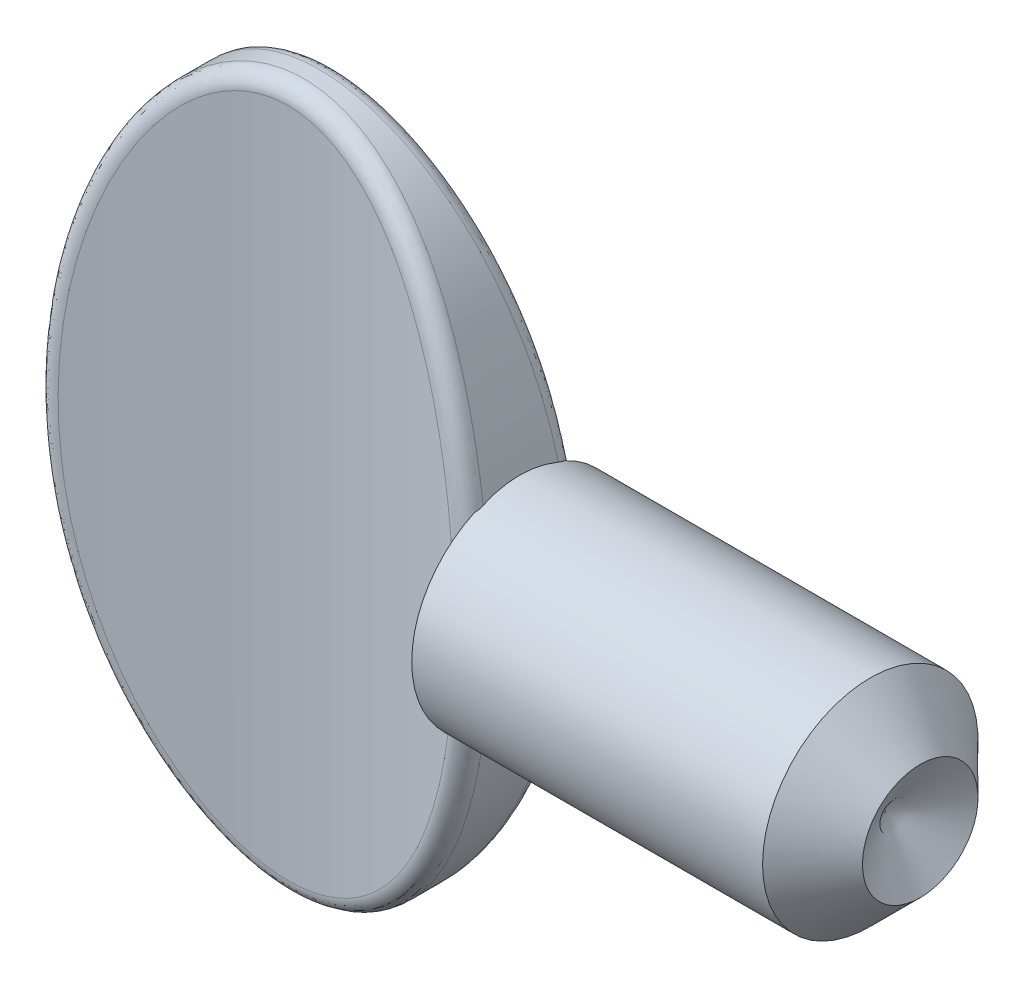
ISO-10303-21;
HEADER;
FILE_DESCRIPTION(('STEP AP214'),'2;1');
FILE_NAME('part.step','',(''),(''),'','','');
FILE_SCHEMA(('AUTOMOTIVE_DESIGN { 1 0 10303 214 1 1 1 1 }'));
ENDSEC;
DATA;
#1=APPLICATION_CONTEXT('core data for automotive mechanical design processes');
#2=APPLICATION_PROTOCOL_DEFINITION('international standard','automotive_design',2000,#1);
#3=PRODUCT_CONTEXT('',#1,'mechanical');
#4=PRODUCT('Part','Part','',(#3));
#5=PRODUCT_RELATED_PRODUCT_CATEGORY('part','',(#4));
#6=PRODUCT_DEFINITION_FORMATION('','',#4);
#7=PRODUCT_DEFINITION_CONTEXT('part definition',#1,'design');
#8=PRODUCT_DEFINITION('design','',#6,#7);
#9=PRODUCT_DEFINITION_SHAPE('','',#8);
#10=(LENGTH_UNIT() NAMED_UNIT(*) SI_UNIT(.MILLI.,.METRE.));
#11=(NAMED_UNIT(*) PLANE_ANGLE_UNIT() SI_UNIT($,.RADIAN.));
#12=(NAMED_UNIT(*) SI_UNIT($,.STERADIAN.) SOLID_ANGLE_UNIT());
#13=UNCERTAINTY_MEASURE_WITH_UNIT(LENGTH_MEASURE(1.E-05),#10,'distance_accuracy_value','');
#14=(GEOMETRIC_REPRESENTATION_CONTEXT(3) GLOBAL_UNCERTAINTY_ASSIGNED_CONTEXT((#13)) GLOBAL_UNIT_ASSIGNED_CONTEXT((#10,
#11,#12)) REPRESENTATION_CONTEXT('',''));
#15=CARTESIAN_POINT('',(0.,0.,0.));
#16=DIRECTION('',(0.,0.,1.));
#17=DIRECTION('',(1.,0.,0.));
#18=AXIS2_PLACEMENT_3D('',#15,#16,#17);
#19=CARTESIAN_POINT('',(0.,0.,1.016));
#20=DIRECTION('',(0.,0.,1.));
#21=DIRECTION('',(0.,-1.,0.));
#22=AXIS2_PLACEMENT_3D('',#19,#20,#21);
#23=ELLIPSE('',#22,5.715,3.556);
#24=DIRECTION('',(0.,0.,-1.));
#25=VECTOR('',#24,1.);
#26=SURFACE_OF_LINEAR_EXTRUSION('',#23,#25);
#27=CARTESIAN_POINT('',(3.41011531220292,-1.62014791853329,0.668376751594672));
#28=CARTESIAN_POINT('',(3.40671804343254,-1.63860905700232,0.623625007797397));
#29=CARTESIAN_POINT('',(3.40360222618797,-1.65521497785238,0.578110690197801));
#30=CARTESIAN_POINT('',(3.39801345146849,-1.68461510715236,0.485826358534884));
#31=CARTESIAN_POINT('',(3.39554052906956,-1.69740910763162,0.439056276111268));
#32=CARTESIAN_POINT('',(3.38920906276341,-1.72990576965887,0.297329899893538));
#33=CARTESIAN_POINT('',(3.38643361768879,-1.74374513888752,0.200903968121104));
#34=CARTESIAN_POINT('',(3.38412486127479,-1.75528275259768,0.00701645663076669));
#35=CARTESIAN_POINT('',(3.38459484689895,-1.75296458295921,-0.0904460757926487));
#36=CARTESIAN_POINT('',(3.38872446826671,-1.73223483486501,-0.283468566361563));
#37=CARTESIAN_POINT('',(3.39237835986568,-1.71385223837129,-0.379031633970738));
#38=CARTESIAN_POINT('',(3.39927526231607,-1.67798412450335,-0.507252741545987));
#39=CARTESIAN_POINT('',(3.40135032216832,-1.66710508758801,-0.541931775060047));
#40=CARTESIAN_POINT('',(3.40584397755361,-1.64323850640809,-0.610479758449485));
#41=CARTESIAN_POINT('',(3.4082620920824,-1.6302539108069,-0.64434976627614));
#42=CARTESIAN_POINT('',(3.41083461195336,-1.61623226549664,-0.677790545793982));
#43=B_SPLINE_CURVE_WITH_KNOTS('',3,(#27,#28,#29,#30,#31,#32,#33,#34,#35,#36,#37,#38,#39,#40,#41,
#42),.UNSPECIFIED.,.F.,.F.,(4,2,2,2,2,2,2,4),(0.,0.145499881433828,0.29100769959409,
0.581851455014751,0.872990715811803,1.16360581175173,1.2727648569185,1.381772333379),.UNSPECIFIED.);
#44=CARTESIAN_POINT('',(3.40596285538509,-1.64255427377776,0.611246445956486));
#45=VERTEX_POINT('',#44);
#46=CARTESIAN_POINT('',(3.40596285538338,-1.6425542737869,-0.611246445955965));
#47=VERTEX_POINT('',#46);
#48=EDGE_CURVE('E56',#45,#47,#43,.T.);
#49=ORIENTED_EDGE('',*,*,#48,.F.);
#50=CARTESIAN_POINT('',(2.87687361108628,2.44813994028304,0.791992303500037));
#51=CARTESIAN_POINT('',(3.18255529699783,2.5496565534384,0.881151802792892));
#52=CARTESIAN_POINT('',(3.19087427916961,2.52247577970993,0.548152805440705));
#53=CARTESIAN_POINT('',(2.94045219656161,2.23528015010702,0.810534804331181));
#54=CARTESIAN_POINT('',(3.25173180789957,2.32661822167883,0.903476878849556));
#55=CARTESIAN_POINT('',(3.25828081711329,2.30224582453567,0.567153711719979));
#56=CARTESIAN_POINT('',(2.99465455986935,2.0192696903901,0.826995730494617));
#57=CARTESIAN_POINT('',(3.31014106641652,2.10195664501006,0.923109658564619));
#58=CARTESIAN_POINT('',(3.31562682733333,2.07916028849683,0.584021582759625));
#59=CARTESIAN_POINT('',(3.08550522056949,1.5830552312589,0.855139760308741));
#60=CARTESIAN_POINT('',(3.40834569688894,1.6476446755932,0.956769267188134));
#61=CARTESIAN_POINT('',(3.41165763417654,1.6291935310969,0.612861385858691));
#62=CARTESIAN_POINT('',(3.12214641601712,1.36284957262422,0.866820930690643));
#63=CARTESIAN_POINT('',(3.44781755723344,1.41867397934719,0.970692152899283));
#64=CARTESIAN_POINT('',(3.45033488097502,1.40231081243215,0.624831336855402));
#65=CARTESIAN_POINT('',(3.17863710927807,0.919742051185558,0.885019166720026));
#66=CARTESIAN_POINT('',(3.50886358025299,0.957217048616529,0.992448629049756));
#67=CARTESIAN_POINT('',(3.50993638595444,0.946080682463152,0.643479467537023));
#68=CARTESIAN_POINT('',(3.19846897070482,0.696837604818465,0.891530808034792));
#69=CARTESIAN_POINT('',(3.53022382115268,0.725447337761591,1.00020785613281));
#70=CARTESIAN_POINT('',(3.53084199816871,0.716730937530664,0.650152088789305));
#71=CARTESIAN_POINT('',(3.22166889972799,0.250038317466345,0.89916161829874));
#72=CARTESIAN_POINT('',(3.55529121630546,0.260137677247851,1.00932947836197));
#73=CARTESIAN_POINT('',(3.55529615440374,0.257136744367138,0.657971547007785));
#74=CARTESIAN_POINT('',(3.22503654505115,0.0261434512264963,0.900280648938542));
#75=CARTESIAN_POINT('',(3.5589182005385,0.0273359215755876,1.01066276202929));
#76=CARTESIAN_POINT('',(3.55884425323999,0.0268922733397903,0.65911824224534));
#77=CARTESIAN_POINT('',(3.21529651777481,-0.424794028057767,0.897065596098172));
#78=CARTESIAN_POINT('',(3.54839475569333,-0.442282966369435,1.00681981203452));
#79=CARTESIAN_POINT('',(3.54857931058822,-0.436885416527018,0.655823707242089));
#80=CARTESIAN_POINT('',(3.20192627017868,-0.651830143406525,0.892644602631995));
#81=CARTESIAN_POINT('',(3.53399566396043,-0.67833751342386,1.00155250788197));
#82=CARTESIAN_POINT('',(3.53448957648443,-0.67041277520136,0.651293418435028));
#83=CARTESIAN_POINT('',(3.15798579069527,-1.10403389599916,0.878342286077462));
#84=CARTESIAN_POINT('',(3.48651511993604,-1.14926850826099,0.984454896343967));
#85=CARTESIAN_POINT('',(3.48815150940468,-1.13578713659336,0.636637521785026));
#86=CARTESIAN_POINT('',(3.12741141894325,-1.32920107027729,0.868459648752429));
#87=CARTESIAN_POINT('',(3.45358537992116,-1.38338047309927,0.972678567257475));
#88=CARTESIAN_POINT('',(3.45589880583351,-1.36763372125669,0.626510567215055));
#89=CARTESIAN_POINT('',(3.04849516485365,-1.77551295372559,0.843590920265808));
#90=CARTESIAN_POINT('',(3.36829281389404,-1.84818795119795,0.942941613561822));
#91=CARTESIAN_POINT('',(3.37255097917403,-1.82763853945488,0.60102703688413));
#92=CARTESIAN_POINT('',(3.00018846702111,-1.99666472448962,0.828614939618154));
#93=CARTESIAN_POINT('',(3.3162505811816,-2.07815631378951,0.925087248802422));
#94=CARTESIAN_POINT('',(3.32149316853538,-2.05580314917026,0.585680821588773));
#95=CARTESIAN_POINT('',(2.88476113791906,-2.43326023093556,0.79411239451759));
#96=CARTESIAN_POINT('',(3.19142384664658,-2.53294503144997,0.883801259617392));
#97=CARTESIAN_POINT('',(3.1992693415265,-2.50695447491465,0.550325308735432));
#98=CARTESIAN_POINT('',(2.81765268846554,-2.64870756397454,0.774588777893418));
#99=CARTESIAN_POINT('',(3.11906951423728,-2.75709243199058,0.860497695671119));
#100=CARTESIAN_POINT('',(3.12811634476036,-2.72994444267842,0.530319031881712));
#101=CARTESIAN_POINT('',(2.65311433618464,-3.0985151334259,0.729048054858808));
#102=CARTESIAN_POINT('',(2.94108253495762,-3.22556424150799,0.805967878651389));
#103=CARTESIAN_POINT('',(2.95319352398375,-3.19660978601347,0.483652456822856));
#104=CARTESIAN_POINT('',(2.55290441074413,-3.33177078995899,0.702519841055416));
#105=CARTESIAN_POINT('',(2.8329712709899,-3.46846636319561,0.77425014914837));
#106=CARTESIAN_POINT('',(2.84641629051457,-3.43928390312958,0.456468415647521));
#107=CARTESIAN_POINT('',(2.32320903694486,-3.78234312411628,0.64640489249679));
#108=CARTESIAN_POINT('',(2.58357223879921,-3.93908503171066,0.706749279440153));
#109=CARTESIAN_POINT('',(2.60051045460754,-3.91004049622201,0.398966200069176));
#110=CARTESIAN_POINT('',(2.19375678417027,-3.99967750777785,0.616821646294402));
#111=CARTESIAN_POINT('',(2.44340804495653,-4.16619911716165,0.67117436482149));
#112=CARTESIAN_POINT('',(2.46141853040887,-4.13813914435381,0.368651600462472));
#113=CARTESIAN_POINT('',(1.94091533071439,-4.3535976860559,0.565411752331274));
#114=CARTESIAN_POINT('',(2.16660546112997,-4.538377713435,0.608745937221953));
#115=CARTESIAN_POINT('',(2.18768136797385,-4.51205711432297,0.315970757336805));
#116=CARTESIAN_POINT('',(1.82542698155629,-4.49608375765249,0.543660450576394));
#117=CARTESIAN_POINT('',(2.04053515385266,-4.68812354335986,0.582339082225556));
#118=CARTESIAN_POINT('',(2.06208689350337,-4.66339853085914,0.29368172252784));
#119=CARTESIAN_POINT('',(1.57466794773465,-4.76186582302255,0.501591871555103));
#120=CARTESIAN_POINT('',(1.76506012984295,-4.96825132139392,0.530990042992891));
#121=CARTESIAN_POINT('',(1.78731476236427,-4.94761823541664,0.250573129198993));
#122=CARTESIAN_POINT('',(1.43943196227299,-4.88519470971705,0.481272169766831));
#123=CARTESIAN_POINT('',(1.6161949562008,-5.09885836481,0.506044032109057));
#124=CARTESIAN_POINT('',(1.63817843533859,-5.080528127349,0.229751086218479));
#125=CARTESIAN_POINT('',(1.19119720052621,-5.07171066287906,0.449763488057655));
#126=CARTESIAN_POINT('',(1.3404297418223,-5.29730303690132,0.467084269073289));
#127=CARTESIAN_POINT('',(1.36169787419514,-5.28324603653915,0.197463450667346));
#128=CARTESIAN_POINT('',(1.08336860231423,-5.14191532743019,0.437647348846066));
#129=CARTESIAN_POINT('',(1.22051144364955,-5.37222170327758,0.452038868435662));
#130=CARTESIAN_POINT('',(1.24085897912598,-5.36011289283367,0.185047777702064));
#131=CARTESIAN_POINT('',(0.858050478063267,-5.26424468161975,0.416270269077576));
#132=CARTESIAN_POINT('',(0.968834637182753,-5.50292549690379,0.425421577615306));
#133=CARTESIAN_POINT('',(0.986440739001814,-5.49490642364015,0.163142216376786));
#134=CARTESIAN_POINT('',(0.740575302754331,-5.31639564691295,0.407005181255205));
#135=CARTESIAN_POINT('',(0.836995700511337,-5.55903773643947,0.413787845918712));
#136=CARTESIAN_POINT('',(0.852880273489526,-5.55286061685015,0.153648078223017));
#137=CARTESIAN_POINT('',(0.515993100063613,-5.39221579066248,0.393443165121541));
#138=CARTESIAN_POINT('',(0.58410467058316,-5.64060692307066,0.396743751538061));
#139=CARTESIAN_POINT('',(0.595858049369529,-5.6375336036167,0.139750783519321));
#140=CARTESIAN_POINT('',(0.409913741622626,-5.41895204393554,0.388614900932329));
#141=CARTESIAN_POINT('',(0.464186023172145,-5.66954672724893,0.390631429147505));
#142=CARTESIAN_POINT('',(0.473813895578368,-5.66759942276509,0.134803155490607));
#143=CARTESIAN_POINT('',(0.194791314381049,-5.45394261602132,0.382284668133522));
#144=CARTESIAN_POINT('',(0.220889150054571,-5.70732589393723,0.382635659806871));
#145=CARTESIAN_POINT('',(0.22551311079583,-5.70700859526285,0.128316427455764));
#146=CARTESIAN_POINT('',(0.0857502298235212,-5.46220901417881,0.380780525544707));
#147=CARTESIAN_POINT('',(0.0971189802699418,-5.7163068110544,0.38072235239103));
#148=CARTESIAN_POINT('',(0.0992592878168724,-5.71636549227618,0.126775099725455));
#149=CARTESIAN_POINT('',(-0.132181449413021,-5.45950203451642,0.381271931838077));
#150=CARTESIAN_POINT('',(-0.149751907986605,-5.7133803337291,0.381344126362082));
#151=CARTESIAN_POINT('',(-0.153008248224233,-5.71330808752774,0.127278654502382));
#152=CARTESIAN_POINT('',(-0.24107184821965,-5.44851292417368,0.383270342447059));
#153=CARTESIAN_POINT('',(-0.273308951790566,-5.70144504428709,0.383885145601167));
#154=CARTESIAN_POINT('',(-0.279021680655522,-5.70087598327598,0.129326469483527));
#155=CARTESIAN_POINT('',(-0.455477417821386,-5.40829096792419,0.39053874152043));
#156=CARTESIAN_POINT('',(-0.515669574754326,-5.65803605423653,0.393060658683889));
#157=CARTESIAN_POINT('',(-0.526267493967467,-5.65561592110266,0.136774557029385));
#158=CARTESIAN_POINT('',(-0.560990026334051,-5.37904460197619,0.395811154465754));
#159=CARTESIAN_POINT('',(-0.634846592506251,-5.6264036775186,0.399728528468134));
#160=CARTESIAN_POINT('',(-0.647496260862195,-5.62277284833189,0.142177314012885));
#161=CARTESIAN_POINT('',(-0.791362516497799,-5.29549090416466,0.410722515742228));
#162=CARTESIAN_POINT('',(-0.894095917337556,-5.53655861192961,0.418454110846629));
#163=CARTESIAN_POINT('',(-0.910741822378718,-5.52960626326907,0.157457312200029));
#164=CARTESIAN_POINT('',(-0.914651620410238,-5.2368066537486,0.421113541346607));
#165=CARTESIAN_POINT('',(-1.03227791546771,-5.47347252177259,0.431484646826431));
#166=CARTESIAN_POINT('',(-1.05060182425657,-5.46452941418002,0.168105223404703));
#167=CARTESIAN_POINT('',(-1.15014100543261,-5.1000145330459,0.444888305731));
#168=CARTESIAN_POINT('',(-1.29493907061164,-5.32749236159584,0.461037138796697));
#169=CARTESIAN_POINT('',(-1.31582055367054,-5.31418719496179,0.192467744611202));
#170=CARTESIAN_POINT('',(-1.26232097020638,-5.02187196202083,0.45827738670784));
#171=CARTESIAN_POINT('',(-1.41945940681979,-5.24422211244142,0.477628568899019));
#172=CARTESIAN_POINT('',(-1.44115278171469,-5.22888577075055,0.20618782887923));
#173=CARTESIAN_POINT('',(-1.5242535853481,-4.81141848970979,0.493480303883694));
#174=CARTESIAN_POINT('',(-1.71006807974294,-5.02053132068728,0.521084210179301));
#175=CARTESIAN_POINT('',(-1.73197783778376,-5.00086686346,0.242261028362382));
#176=CARTESIAN_POINT('',(-1.66743267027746,-4.67075761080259,0.516329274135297));
#177=CARTESIAN_POINT('',(-1.86727379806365,-4.87182691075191,0.549058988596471));
#178=CARTESIAN_POINT('',(-1.88928718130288,-4.84982635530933,0.265674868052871));
#179=CARTESIAN_POINT('',(-1.93076565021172,-4.36861808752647,0.563157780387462));
#180=CARTESIAN_POINT('',(-2.15601250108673,-4.5538689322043,0.606083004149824));
#181=CARTESIAN_POINT('',(-2.17678970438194,-4.52789876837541,0.313661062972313));
#182=CARTESIAN_POINT('',(-2.05086652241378,-4.20709289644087,0.587139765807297));
#183=CARTESIAN_POINT('',(-2.28680032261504,-4.38442619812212,0.635112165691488));
#184=CARTESIAN_POINT('',(-2.30692049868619,-4.35696740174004,0.338235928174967));
#185=CARTESIAN_POINT('',(-2.24774440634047,-3.90468381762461,0.629494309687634));
#186=CARTESIAN_POINT('',(-2.50094051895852,-4.0683012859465,0.686196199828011));
#187=CARTESIAN_POINT('',(-2.51931723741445,-4.03858337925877,0.38163755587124));
#188=CARTESIAN_POINT('',(-2.32835126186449,-3.7663893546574,0.648005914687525));
#189=CARTESIAN_POINT('',(-2.58844569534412,-3.92375543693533,0.708482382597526));
#190=CARTESIAN_POINT('',(-2.60592272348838,-3.89353451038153,0.400606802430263));
#191=CARTESIAN_POINT('',(-2.47764655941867,-3.48301662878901,0.683921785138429));
#192=CARTESIAN_POINT('',(-2.75059891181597,-3.62773016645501,0.751698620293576));
#193=CARTESIAN_POINT('',(-2.76590357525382,-3.59720408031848,0.437410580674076));
#194=CARTESIAN_POINT('',(-2.54632812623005,-3.33793451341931,0.701325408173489));
#195=CARTESIAN_POINT('',(-2.82495665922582,-3.47639034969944,0.772577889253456));
#196=CARTESIAN_POINT('',(-2.83927131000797,-3.44591898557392,0.455244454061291));
#197=CARTESIAN_POINT('',(-2.73596214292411,-2.89487609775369,0.751105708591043));
#198=CARTESIAN_POINT('',(-3.03164049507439,-3.01174573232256,0.832642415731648));
#199=CARTESIAN_POINT('',(-3.04146428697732,-2.98492820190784,0.506255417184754));
#200=CARTESIAN_POINT('',(-2.84046694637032,-2.58914736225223,0.781043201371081));
#201=CARTESIAN_POINT('',(-3.1439027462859,-2.69404108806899,0.868280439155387));
#202=CARTESIAN_POINT('',(-3.15233965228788,-2.66814963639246,0.53693302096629));
#203=CARTESIAN_POINT('',(-3.02361670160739,-1.91917408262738,0.835455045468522));
#204=CARTESIAN_POINT('',(-3.34221273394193,-1.99525212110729,0.933484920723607));
#205=CARTESIAN_POINT('',(-3.34632626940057,-1.9756230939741,0.592690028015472));
#206=CARTESIAN_POINT('',(-3.09598835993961,-1.55305613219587,0.858425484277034));
#207=CARTESIAN_POINT('',(-3.41971506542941,-1.61558535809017,0.960711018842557));
#208=CARTESIAN_POINT('',(-3.42273238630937,-1.59818444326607,0.6162283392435));
#209=CARTESIAN_POINT('',(-3.19389380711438,-0.813438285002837,0.889906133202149));
#210=CARTESIAN_POINT('',(-3.52551559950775,-0.845326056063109,0.998352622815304));
#211=CARTESIAN_POINT('',(-3.52603668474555,-0.836598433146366,0.648487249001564));
#212=CARTESIAN_POINT('',(-3.21939459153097,-0.439933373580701,0.89840615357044));
#213=CARTESIAN_POINT('',(-3.55284253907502,-0.458062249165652,1.00842962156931));
#214=CARTESIAN_POINT('',(-3.55289998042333,-0.452446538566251,0.657197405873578));
#215=CARTESIAN_POINT('',(-3.22377462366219,0.165515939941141,0.89987188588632));
#216=CARTESIAN_POINT('',(-3.55753925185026,0.172415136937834,1.01016840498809));
#217=CARTESIAN_POINT('',(-3.55751322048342,0.170223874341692,0.658699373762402));
#218=CARTESIAN_POINT('',(-3.21666132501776,0.397456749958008,0.897504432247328));
#219=CARTESIAN_POINT('',(-3.54988979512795,0.413553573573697,1.00735185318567));
#220=CARTESIAN_POINT('',(-3.55001934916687,0.408752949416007,0.656273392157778));
#221=CARTESIAN_POINT('',(-3.18467556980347,0.860036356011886,0.887014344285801));
#222=CARTESIAN_POINT('',(-3.51533559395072,0.895293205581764,0.994814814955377));
#223=CARTESIAN_POINT('',(-3.51629985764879,0.884649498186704,0.645523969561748));
#224=CARTESIAN_POINT('',(-3.15979714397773,1.09067468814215,0.878889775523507));
#225=CARTESIAN_POINT('',(-3.4885425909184,1.13507534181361,0.985134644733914));
#226=CARTESIAN_POINT('',(-3.49006794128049,1.12201655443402,0.637198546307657));
#227=CARTESIAN_POINT('',(-3.09177046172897,1.54865418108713,0.857163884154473));
#228=CARTESIAN_POINT('',(-3.41502593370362,1.61202494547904,0.959158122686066));
#229=CARTESIAN_POINT('',(-3.41826670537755,1.59374884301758,0.614935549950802));
#230=CARTESIAN_POINT('',(-3.04863796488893,1.77599801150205,0.843567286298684));
#231=CARTESIAN_POINT('',(-3.36857207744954,1.84840189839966,0.942954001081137));
#232=CARTESIAN_POINT('',(-3.37271406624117,1.82811648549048,0.601002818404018));
#233=CARTESIAN_POINT('',(-2.94317111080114,2.22543485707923,0.81141809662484));
#234=CARTESIAN_POINT('',(-3.25454291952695,2.31651004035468,0.904496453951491));
#235=CARTESIAN_POINT('',(-3.26114490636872,2.29208476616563,0.568058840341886));
#236=CARTESIAN_POINT('',(-2.88084877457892,2.44753106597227,0.792868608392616));
#237=CARTESIAN_POINT('',(-3.18737593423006,2.5475035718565,0.882369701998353));
#238=CARTESIAN_POINT('',(-3.19514119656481,2.52168829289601,0.549050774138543));
#239=CARTESIAN_POINT('',(-2.72296807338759,2.92171701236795,0.747996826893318));
#240=CARTESIAN_POINT('',(-3.01671846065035,3.04112688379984,0.828682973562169));
#241=CARTESIAN_POINT('',(-3.02753524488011,3.01295829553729,0.503069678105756));
#242=CARTESIAN_POINT('',(-2.62354531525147,3.17242818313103,0.720887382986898));
#243=CARTESIAN_POINT('',(-2.90958371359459,3.30205054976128,0.796309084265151));
#244=CARTESIAN_POINT('',(-2.92177195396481,3.27338041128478,0.475290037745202));
#245=CARTESIAN_POINT('',(-2.45047373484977,3.53592668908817,0.677330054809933));
#246=CARTESIAN_POINT('',(-2.72089131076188,3.68328686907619,0.743720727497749));
#247=CARTESIAN_POINT('',(-2.73679732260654,3.65249750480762,0.430655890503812));
#248=CARTESIAN_POINT('',(-2.38881716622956,3.6549621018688,0.662334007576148));
#249=CARTESIAN_POINT('',(-2.65403373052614,3.80757139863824,0.725698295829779));
#250=CARTESIAN_POINT('',(-2.67077613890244,3.77691258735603,0.41528911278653));
#251=CARTESIAN_POINT('',(-2.25689122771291,3.88780573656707,0.631713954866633));
#252=CARTESIAN_POINT('',(-2.51060863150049,4.05097871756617,0.688809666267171));
#253=CARTESIAN_POINT('',(-2.52910566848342,4.02092289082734,0.383912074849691));
#254=CARTESIAN_POINT('',(-2.1866245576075,4.00161558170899,0.6160901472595));
#255=CARTESIAN_POINT('',(-2.43421779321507,4.1700328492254,0.669971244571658));
#256=CARTESIAN_POINT('',(-2.45345939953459,4.14051960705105,0.367902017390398));
#257=CARTESIAN_POINT('',(-2.00630311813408,4.26762511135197,0.57821491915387));
#258=CARTESIAN_POINT('',(-2.23805461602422,4.44810307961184,0.624273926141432));
#259=CARTESIAN_POINT('',(-2.25863520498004,4.42099703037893,0.329090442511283));
#260=CARTESIAN_POINT('',(-1.89168515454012,4.4166251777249,0.555850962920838));
#261=CARTESIAN_POINT('',(-2.11309442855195,4.6045146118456,0.597170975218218));
#262=CARTESIAN_POINT('',(-2.13426125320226,4.57889839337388,0.306173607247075));
#263=CARTESIAN_POINT('',(-1.64204982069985,4.69578543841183,0.512276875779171));
#264=CARTESIAN_POINT('',(-1.83921681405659,4.89842163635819,0.544072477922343));
#265=CARTESIAN_POINT('',(-1.86139526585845,4.87668575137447,0.261522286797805));
#266=CARTESIAN_POINT('',(-1.50706569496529,4.82597567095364,0.491064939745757));
#267=CARTESIAN_POINT('',(-1.69088789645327,5.03609559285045,0.5180866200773));
#268=CARTESIAN_POINT('',(-1.71294250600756,5.01660042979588,0.239785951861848));
#269=CARTESIAN_POINT('',(-1.25822257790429,5.02460380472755,0.457805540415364));
#270=CARTESIAN_POINT('',(-1.41485811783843,5.24717231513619,0.47703595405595));
#271=CARTESIAN_POINT('',(-1.43656618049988,5.23187493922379,0.205704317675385));
#272=CARTESIAN_POINT('',(-1.14977220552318,5.09995591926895,0.444894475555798));
#273=CARTESIAN_POINT('',(-1.29446557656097,5.32746078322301,0.461038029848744));
#274=CARTESIAN_POINT('',(-1.31538358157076,5.31413478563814,0.192474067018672));
#275=CARTESIAN_POINT('',(-0.922470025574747,5.23252776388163,0.421861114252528));
#276=CARTESIAN_POINT('',(-1.040964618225,5.46892516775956,0.432410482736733));
#277=CARTESIAN_POINT('',(-1.05942783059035,5.45981518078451,0.16887127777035));
#278=CARTESIAN_POINT('',(-0.80363402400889,5.28977445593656,0.411734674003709));
#279=CARTESIAN_POINT('',(-0.907817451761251,5.53043531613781,0.419719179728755));
#280=CARTESIAN_POINT('',(-0.92467528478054,5.52326373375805,0.158494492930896));
#281=CARTESIAN_POINT('',(-0.577455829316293,5.37398354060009,0.39672020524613));
#282=CARTESIAN_POINT('',(-0.653408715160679,5.62094693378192,0.400873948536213));
#283=CARTESIAN_POINT('',(-0.666376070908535,5.61710585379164,0.143108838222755));
#284=CARTESIAN_POINT('',(-0.471370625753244,5.4043497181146,0.391249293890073));
#285=CARTESIAN_POINT('',(-0.533622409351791,5.65378212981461,0.393957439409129));
#286=CARTESIAN_POINT('',(-0.544550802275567,5.65118930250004,0.13750267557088));
#287=CARTESIAN_POINT('',(-0.255633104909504,5.44661210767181,0.383615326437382));
#288=CARTESIAN_POINT('',(-0.289803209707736,5.69938537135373,0.384322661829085));
#289=CARTESIAN_POINT('',(-0.295851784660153,5.69872932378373,0.129679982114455));
#290=CARTESIAN_POINT('',(-0.145983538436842,5.45852223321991,0.38144977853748));
#291=CARTESIAN_POINT('',(-0.165395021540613,5.71232072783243,0.381569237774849));
#292=CARTESIAN_POINT('',(-0.168981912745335,5.71220143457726,0.127460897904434));
#293=CARTESIAN_POINT('',(0.0738869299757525,5.46278107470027,0.38067670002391));
#294=CARTESIAN_POINT('',(0.0836678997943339,5.71692492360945,0.380591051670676));
#295=CARTESIAN_POINT('',(0.0855232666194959,5.71701154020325,0.126668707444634));
#296=CARTESIAN_POINT('',(0.184108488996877,5.45509623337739,0.382075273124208));
#297=CARTESIAN_POINT('',(0.208792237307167,5.70857455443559,0.382370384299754));
#298=CARTESIAN_POINT('',(0.213159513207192,5.70831156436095,0.128101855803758));
#299=CARTESIAN_POINT('',(0.401619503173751,5.42083768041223,0.38827437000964));
#300=CARTESIAN_POINT('',(0.454815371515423,5.67158273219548,0.390201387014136));
#301=CARTESIAN_POINT('',(0.464261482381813,5.6697201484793,0.134454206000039));
#302=CARTESIAN_POINT('',(0.50890688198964,5.3942509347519,0.393077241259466));
#303=CARTESIAN_POINT('',(0.576122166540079,5.64279808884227,0.396283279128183));
#304=CARTESIAN_POINT('',(0.587724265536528,5.6398140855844,0.13937581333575));
#305=CARTESIAN_POINT('',(0.739415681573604,5.31719606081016,0.406864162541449));
#306=CARTESIAN_POINT('',(0.835739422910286,5.55988553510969,0.413613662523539));
#307=CARTESIAN_POINT('',(0.851580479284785,5.55374603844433,0.153503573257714));
#308=CARTESIAN_POINT('',(0.861383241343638,5.26294420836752,0.416504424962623));
#309=CARTESIAN_POINT('',(0.972626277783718,5.50149772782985,0.425721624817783));
#310=CARTESIAN_POINT('',(0.990242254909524,5.49345262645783,0.163382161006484));
#311=CARTESIAN_POINT('',(1.0949077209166,5.13510542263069,0.438830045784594));
#312=CARTESIAN_POINT('',(1.23342883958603,5.36492676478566,0.453514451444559));
#313=CARTESIAN_POINT('',(1.25384684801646,5.35263149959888,0.186259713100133));
#314=CARTESIAN_POINT('',(1.20644657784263,5.06148575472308,0.451520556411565));
#315=CARTESIAN_POINT('',(1.35742533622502,5.28637625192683,0.469268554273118));
#316=CARTESIAN_POINT('',(1.37876592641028,5.27206953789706,0.199263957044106));
#317=CARTESIAN_POINT('',(1.46573802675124,4.86335533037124,0.484912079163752));
#318=CARTESIAN_POINT('',(1.64542638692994,5.07559446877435,0.51054553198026));
#319=CARTESIAN_POINT('',(1.66733639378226,5.05689690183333,0.23348098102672));
#320=CARTESIAN_POINT('',(1.60745261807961,4.7307918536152,0.506661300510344));
#321=CARTESIAN_POINT('',(1.80127145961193,4.93527393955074,0.537224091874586));
#322=CARTESIAN_POINT('',(1.82341116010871,4.91420625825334,0.25576788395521));
#323=CARTESIAN_POINT('',(1.86900175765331,4.44495554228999,0.551550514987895));
#324=CARTESIAN_POINT('',(2.08839377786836,4.63419132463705,0.591965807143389));
#325=CARTESIAN_POINT('',(2.1096020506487,4.60897313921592,0.301766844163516));
#326=CARTESIAN_POINT('',(1.98878809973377,4.29163833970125,0.574693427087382));
#327=CARTESIAN_POINT('',(2.21900804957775,4.47319746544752,0.620024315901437));
#328=CARTESIAN_POINT('',(2.23966103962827,4.44638820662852,0.325481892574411));
#329=CARTESIAN_POINT('',(2.18584389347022,4.00402857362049,0.615817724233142));
#330=CARTESIAN_POINT('',(2.43354527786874,4.17232015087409,0.669684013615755));
#331=CARTESIAN_POINT('',(2.45265033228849,4.14301394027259,0.367622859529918));
#332=CARTESIAN_POINT('',(2.26678612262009,3.87233883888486,0.633878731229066));
#333=CARTESIAN_POINT('',(2.52149542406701,4.03457978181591,0.691453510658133));
#334=CARTESIAN_POINT('',(2.53976764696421,4.00465027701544,0.386130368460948));
#335=CARTESIAN_POINT('',(2.4172945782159,3.60212171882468,0.669113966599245));
#336=CARTESIAN_POINT('',(2.68508948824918,3.7521515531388,0.733890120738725));
#337=CARTESIAN_POINT('',(2.70131013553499,3.72162071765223,0.422236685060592));
#338=CARTESIAN_POINT('',(2.48685442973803,3.46359055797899,0.686287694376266));
#339=CARTESIAN_POINT('',(2.76046142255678,3.60757416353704,0.754513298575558));
#340=CARTESIAN_POINT('',(2.77572819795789,3.57695134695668,0.439834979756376));
#341=CARTESIAN_POINT('',(2.61551558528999,3.18118784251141,0.719268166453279));
#342=CARTESIAN_POINT('',(2.89998706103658,3.31289252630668,0.794118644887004));
#343=CARTESIAN_POINT('',(2.91309166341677,3.28272006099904,0.473630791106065));
#344=CARTESIAN_POINT('',(2.6746042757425,3.03731009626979,0.73507325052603));
#345=CARTESIAN_POINT('',(2.96389868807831,3.16294480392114,0.813050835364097));
#346=CARTESIAN_POINT('',(2.97602323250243,3.13315249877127,0.489826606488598));
#347=CARTESIAN_POINT('',(2.78296275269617,2.74552013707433,0.76492544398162));
#348=CARTESIAN_POINT('',(3.08122852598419,2.85877616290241,0.848829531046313));
#349=CARTESIAN_POINT('',(3.09125015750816,2.83035190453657,0.520416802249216));
#350=CARTESIAN_POINT('',(2.83222971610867,2.59760677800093,0.778972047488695));
#351=CARTESIAN_POINT('',(3.13445317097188,2.70474702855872,0.865627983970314));
#352=CARTESIAN_POINT('',(3.14354245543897,2.67711783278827,0.534810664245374));
#353=CARTESIAN_POINT('',(2.87687361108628,2.44813994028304,0.791992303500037));
#354=CARTESIAN_POINT('',(3.18255529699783,2.5496565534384,0.881151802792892));
#355=CARTESIAN_POINT('',(3.19087427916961,2.52247577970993,0.548152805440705));
#356=(BOUNDED_SURFACE() B_SPLINE_SURFACE(3,2,((#50,#51,#52),(#53,#54,#55),(#56,#57,#58),(#59,
#60,#61),(#62,#63,#64),(#65,#66,#67),(#68,#69,#70),(#71,#72,#73),(#74,#75,#76),(#77,#78,#79),
(#80,#81,#82),(#83,#84,#85),(#86,#87,#88),(#89,#90,#91),(#92,#93,#94),(#95,#96,#97),(#98,#99,
#100),(#101,#102,#103),(#104,#105,#106),(#107,#108,#109),(#110,#111,#112),(#113,#114,#115),
(#116,#117,#118),(#119,#120,#121),(#122,#123,#124),(#125,#126,#127),(#128,#129,#130),(#131,#132,
#133),(#134,#135,#136),(#137,#138,#139),(#140,#141,#142),(#143,#144,#145),(#146,#147,#148),
(#149,#150,#151),(#152,#153,#154),(#155,#156,#157),(#158,#159,#160),(#161,#162,#163),(#164,#165,
#166),(#167,#168,#169),(#170,#171,#172),(#173,#174,#175),(#176,#177,#178),(#179,#180,#181),
(#182,#183,#184),(#185,#186,#187),(#188,#189,#190),(#191,#192,#193),(#194,#195,#196),(#197,#198,
#199),(#200,#201,#202),(#203,#204,#205),(#206,#207,#208),(#209,#210,#211),(#212,#213,#214),
(#215,#216,#217),(#218,#219,#220),(#221,#222,#223),(#224,#225,#226),(#227,#228,#229),(#230,#231,
#232),(#233,#234,#235),(#236,#237,#238),(#239,#240,#241),(#242,#243,#244),(#245,#246,#247),
(#248,#249,#250),(#251,#252,#253),(#254,#255,#256),(#257,#258,#259),(#260,#261,#262),(#263,#264,
#265),(#266,#267,#268),(#269,#270,#271),(#272,#273,#274),(#275,#276,#277),(#278,#279,#280),
(#281,#282,#283),(#284,#285,#286),(#287,#288,#289),(#290,#291,#292),(#293,#294,#295),(#296,#297,
#298),(#299,#300,#301),(#302,#303,#304),(#305,#306,#307),(#308,#309,#310),(#311,#312,#313),
(#314,#315,#316),(#317,#318,#319),(#320,#321,#322),(#323,#324,#325),(#326,#327,#328),(#329,#330,
#331),(#332,#333,#334),(#335,#336,#337),(#338,#339,#340),(#341,#342,#343),(#344,#345,#346),
(#347,#348,#349),(#350,#351,#352),(#353,#354,#355)),.UNSPECIFIED.,.T.,.F.,
.F.) B_SPLINE_SURFACE_WITH_KNOTS((4,2,2,2,2,2,2,2,2,2,2,2,2,2,2,2,2,2,2,2,2,2,2,2,2,2,2,2,2,2,2,
2,2,2,2,2,2,2,2,2,2,2,2,2,2,2,2,2,2,2,4),(3,3),(0.,0.670088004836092,1.34044677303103,
2.01150801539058,2.68258646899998,3.36432560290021,4.04622885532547,4.72678632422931,
5.40690386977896,6.17399274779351,6.94021517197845,7.49835151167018,8.05551867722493,
8.44869733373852,8.84130132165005,9.17597761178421,9.51043495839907,9.8451656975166,
10.1801446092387,10.5969595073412,11.0145231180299,11.6249253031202,12.2367135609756,
12.7226461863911,13.2088580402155,14.1814928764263,15.3007522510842,16.4207994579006,
17.116313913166,17.8120621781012,18.5072109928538,19.2019252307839,20.0156340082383,
20.4222285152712,20.8286958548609,21.4003838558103,21.9711485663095,22.3745805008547,
22.7774087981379,23.1149751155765,23.4522868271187,23.7901765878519,24.1282995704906,
24.5358772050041,24.9441481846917,25.5345239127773,26.1261823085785,26.5957484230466,
27.0655766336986,27.5359670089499,28.0064923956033),(0.,1.),
.UNSPECIFIED.) GEOMETRIC_REPRESENTATION_ITEM() RATIONAL_B_SPLINE_SURFACE(((1.,0.605083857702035,
1.),(1.,0.60161178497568,1.),(1.,0.598611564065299,1.),(1.,0.593550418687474,1.),(1.,
0.591489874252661,1.),(1.,0.588302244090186,1.),(1.,0.587176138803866,1.),(1.,0.585858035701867,
1.),(1.,0.585666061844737,1.),(1.,0.586220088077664,1.),(1.,0.586981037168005,1.),(1.,
0.589468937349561,1.),(1.,0.591196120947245,1.),(1.,0.595617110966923,1.),(1.,0.598309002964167,
1.),(1.,0.604664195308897,1.),(1.,0.608326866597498,1.),(1.,0.617156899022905,1.),(1.,
0.622456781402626,1.),(1.,0.634262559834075,1.),(1.,0.640767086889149,1.),(1.,0.652862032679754,
1.),(1.,0.65822097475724,1.),(1.,0.66920554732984,1.),(1.,0.674830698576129,1.),(1.,
0.684105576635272,1.),(1.,0.687849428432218,1.),(1.,0.694725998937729,1.),(1.,0.697859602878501,
1.),(1.,0.70257659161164,1.),(1.,0.704320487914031,1.),(1.,0.706625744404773,1.),(1.,
0.70718787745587,1.),(1.,0.70700627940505,1.),(1.,0.706261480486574,1.),(1.,0.703627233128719,
1.),(1.,0.701736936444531,1.),(1.,0.696594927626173,1.),(1.,0.693123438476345,1.),(1.,
0.685596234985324,1.),(1.,0.681539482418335,1.),(1.,0.6714001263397,1.),(1.,0.665247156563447,
1.),(1.,0.653377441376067,1.),(1.,0.647661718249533,1.),(1.,0.638021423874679,1.),(1.,
0.633970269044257,1.),(1.,0.626341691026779,1.),(1.,0.622764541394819,1.),(1.,0.612770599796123,
1.),(1.,0.607093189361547,1.),(1.,0.597028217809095,1.),(1.,0.59296412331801,1.),(1.,
0.58744293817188,1.),(1.,0.585987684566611,1.),(1.,0.585737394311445,1.),(1.,0.586143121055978,
1.),(1.,0.587958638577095,1.),(1.,0.589368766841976,1.),(1.,0.59319654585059,1.),(1.,
0.595613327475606,1.),(1.,0.601457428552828,1.),(1.,0.604884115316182,1.),(1.,0.613433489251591,
1.),(1.,0.618746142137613,1.),(1.,0.627733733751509,1.),(1.,0.630898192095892,1.),(1.,
0.637550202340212,1.),(1.,0.64103765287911,1.),(1.,0.649782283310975,1.),(1.,0.655182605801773,
1.),(1.,0.666333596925,1.),(1.,0.672083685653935,1.),(1.,0.681684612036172,1.),(1.,
0.685598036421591,1.),(1.,0.692883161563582,1.),(1.,0.696255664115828,1.),(1.,0.701416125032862,
1.),(1.,0.703372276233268,1.),(1.,0.706134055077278,1.),(1.,0.706940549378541,1.),(1.,
0.707226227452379,1.),(1.,0.706703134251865,1.),(1.,0.70444356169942,1.),(1.,0.702706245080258,
1.),(1.,0.697906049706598,1.),(1.,0.694644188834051,1.),(1.,0.687475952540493,1.),(1.,
0.683568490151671,1.),(1.,0.673792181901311,1.),(1.,0.667825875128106,1.),(1.,0.656237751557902,
1.),(1.,0.650616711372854,1.),(1.,0.641085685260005,1.),(1.,0.637061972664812,1.),(1.,
0.62944847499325,1.),(1.,0.625858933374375,1.),(1.,0.619133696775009,1.),(1.,0.615998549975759,
1.),(1.,0.610192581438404,1.),(1.,0.60752189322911,1.),(1.,0.605083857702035,1.))) REPRESENTATION_ITEM('') SURFACE());
#357=CARTESIAN_POINT('',(3.19087427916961,2.52247577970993,0.548152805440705));
#358=CARTESIAN_POINT('',(3.25828081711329,2.30224582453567,0.567153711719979));
#359=CARTESIAN_POINT('',(3.31562682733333,2.07916028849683,0.584021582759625));
#360=CARTESIAN_POINT('',(3.41165763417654,1.6291935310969,0.612861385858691));
#361=CARTESIAN_POINT('',(3.45033488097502,1.40231081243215,0.624831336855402));
#362=CARTESIAN_POINT('',(3.50993638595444,0.946080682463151,0.643479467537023));
#363=CARTESIAN_POINT('',(3.53084199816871,0.716730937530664,0.650152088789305));
#364=CARTESIAN_POINT('',(3.55529615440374,0.257136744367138,0.657971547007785));
#365=CARTESIAN_POINT('',(3.55884425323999,0.0268922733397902,0.65911824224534));
#366=CARTESIAN_POINT('',(3.54857931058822,-0.436885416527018,0.655823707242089));
#367=CARTESIAN_POINT('',(3.53448957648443,-0.67041277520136,0.651293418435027));
#368=CARTESIAN_POINT('',(3.48815150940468,-1.13578713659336,0.636637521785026));
#369=CARTESIAN_POINT('',(3.45589880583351,-1.36763372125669,0.626510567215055));
#370=CARTESIAN_POINT('',(3.37255097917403,-1.82763853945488,0.60102703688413));
#371=CARTESIAN_POINT('',(3.32149316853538,-2.05580314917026,0.585680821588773));
#372=CARTESIAN_POINT('',(3.1992693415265,-2.50695447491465,0.550325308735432));
#373=CARTESIAN_POINT('',(3.12811634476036,-2.72994444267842,0.530319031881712));
#374=CARTESIAN_POINT('',(2.95319352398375,-3.19660978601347,0.483652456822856));
#375=CARTESIAN_POINT('',(2.84641629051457,-3.43928390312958,0.456468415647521));
#376=CARTESIAN_POINT('',(2.60051045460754,-3.91004049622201,0.398966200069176));
#377=CARTESIAN_POINT('',(2.46141853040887,-4.13813914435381,0.368651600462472));
#378=CARTESIAN_POINT('',(2.18768136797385,-4.51205711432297,0.315970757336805));
#379=CARTESIAN_POINT('',(2.06208689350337,-4.66339853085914,0.29368172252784));
#380=CARTESIAN_POINT('',(1.78731476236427,-4.94761823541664,0.250573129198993));
#381=CARTESIAN_POINT('',(1.63817843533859,-5.080528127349,0.229751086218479));
#382=CARTESIAN_POINT('',(1.36169787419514,-5.28324603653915,0.197463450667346));
#383=CARTESIAN_POINT('',(1.24085897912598,-5.36011289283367,0.185047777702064));
#384=CARTESIAN_POINT('',(0.986440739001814,-5.49490642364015,0.163142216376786));
#385=CARTESIAN_POINT('',(0.852880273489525,-5.55286061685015,0.153648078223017));
#386=CARTESIAN_POINT('',(0.595858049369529,-5.6375336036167,0.139750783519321));
#387=CARTESIAN_POINT('',(0.473813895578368,-5.66759942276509,0.134803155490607));
#388=CARTESIAN_POINT('',(0.22551311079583,-5.70700859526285,0.128316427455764));
#389=CARTESIAN_POINT('',(0.0992592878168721,-5.71636549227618,0.126775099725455));
#390=CARTESIAN_POINT('',(-0.153008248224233,-5.71330808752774,0.127278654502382));
#391=CARTESIAN_POINT('',(-0.279021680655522,-5.70087598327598,0.129326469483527));
#392=CARTESIAN_POINT('',(-0.526267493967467,-5.65561592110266,0.136774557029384));
#393=CARTESIAN_POINT('',(-0.647496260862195,-5.62277284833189,0.142177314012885));
#394=CARTESIAN_POINT('',(-0.910741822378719,-5.52960626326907,0.157457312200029));
#395=CARTESIAN_POINT('',(-1.05060182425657,-5.46452941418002,0.168105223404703));
#396=CARTESIAN_POINT('',(-1.31582055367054,-5.31418719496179,0.192467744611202));
#397=CARTESIAN_POINT('',(-1.44115278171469,-5.22888577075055,0.20618782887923));
#398=CARTESIAN_POINT('',(-1.73197783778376,-5.00086686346,0.242261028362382));
#399=CARTESIAN_POINT('',(-1.88928718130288,-4.84982635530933,0.265674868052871));
#400=CARTESIAN_POINT('',(-2.17678970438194,-4.52789876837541,0.313661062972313));
#401=CARTESIAN_POINT('',(-2.30692049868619,-4.35696740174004,0.338235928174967));
#402=CARTESIAN_POINT('',(-2.51931723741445,-4.03858337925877,0.38163755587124));
#403=CARTESIAN_POINT('',(-2.60592272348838,-3.89353451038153,0.400606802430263));
#404=CARTESIAN_POINT('',(-2.76590357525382,-3.59720408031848,0.437410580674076));
#405=CARTESIAN_POINT('',(-2.83927131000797,-3.44591898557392,0.455244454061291));
#406=CARTESIAN_POINT('',(-3.04146428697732,-2.98492820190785,0.506255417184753));
#407=CARTESIAN_POINT('',(-3.15233965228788,-2.66814963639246,0.53693302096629));
#408=CARTESIAN_POINT('',(-3.34632626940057,-1.9756230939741,0.592690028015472));
#409=CARTESIAN_POINT('',(-3.42273238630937,-1.59818444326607,0.6162283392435));
#410=CARTESIAN_POINT('',(-3.52603668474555,-0.836598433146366,0.648487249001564));
#411=CARTESIAN_POINT('',(-3.55289998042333,-0.452446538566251,0.657197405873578));
#412=CARTESIAN_POINT('',(-3.55751322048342,0.170223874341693,0.658699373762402));
#413=CARTESIAN_POINT('',(-3.55001934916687,0.408752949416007,0.656273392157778));
#414=CARTESIAN_POINT('',(-3.51629985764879,0.884649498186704,0.645523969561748));
#415=CARTESIAN_POINT('',(-3.49006794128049,1.12201655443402,0.637198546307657));
#416=CARTESIAN_POINT('',(-3.41826670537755,1.59374884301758,0.614935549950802));
#417=CARTESIAN_POINT('',(-3.37271406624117,1.82811648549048,0.601002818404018));
#418=CARTESIAN_POINT('',(-3.26114490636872,2.29208476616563,0.568058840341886));
#419=CARTESIAN_POINT('',(-3.19514119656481,2.52168829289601,0.549050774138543));
#420=CARTESIAN_POINT('',(-3.02753524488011,3.01295829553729,0.503069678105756));
#421=CARTESIAN_POINT('',(-2.92177195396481,3.27338041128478,0.475290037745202));
#422=CARTESIAN_POINT('',(-2.73679732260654,3.65249750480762,0.430655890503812));
#423=CARTESIAN_POINT('',(-2.67077613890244,3.77691258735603,0.41528911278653));
#424=CARTESIAN_POINT('',(-2.52910566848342,4.02092289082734,0.383912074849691));
#425=CARTESIAN_POINT('',(-2.45345939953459,4.14051960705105,0.367902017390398));
#426=CARTESIAN_POINT('',(-2.25863520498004,4.42099703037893,0.329090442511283));
#427=CARTESIAN_POINT('',(-2.13426125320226,4.57889839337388,0.306173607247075));
#428=CARTESIAN_POINT('',(-1.86139526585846,4.87668575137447,0.261522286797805));
#429=CARTESIAN_POINT('',(-1.71294250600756,5.01660042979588,0.239785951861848));
#430=CARTESIAN_POINT('',(-1.43656618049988,5.23187493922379,0.205704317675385));
#431=CARTESIAN_POINT('',(-1.31538358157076,5.31413478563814,0.192474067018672));
#432=CARTESIAN_POINT('',(-1.05942783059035,5.45981518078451,0.16887127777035));
#433=CARTESIAN_POINT('',(-0.92467528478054,5.52326373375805,0.158494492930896));
#434=CARTESIAN_POINT('',(-0.666376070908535,5.61710585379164,0.143108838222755));
#435=CARTESIAN_POINT('',(-0.544550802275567,5.65118930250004,0.13750267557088));
#436=CARTESIAN_POINT('',(-0.295851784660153,5.69872932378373,0.129679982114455));
#437=CARTESIAN_POINT('',(-0.168981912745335,5.71220143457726,0.127460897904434));
#438=CARTESIAN_POINT('',(0.0855232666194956,5.71701154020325,0.126668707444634));
#439=CARTESIAN_POINT('',(0.213159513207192,5.70831156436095,0.128101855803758));
#440=CARTESIAN_POINT('',(0.464261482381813,5.6697201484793,0.134454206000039));
#441=CARTESIAN_POINT('',(0.587724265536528,5.6398140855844,0.13937581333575));
#442=CARTESIAN_POINT('',(0.851580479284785,5.55374603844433,0.153503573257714));
#443=CARTESIAN_POINT('',(0.990242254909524,5.49345262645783,0.163382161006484));
#444=CARTESIAN_POINT('',(1.25384684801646,5.35263149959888,0.186259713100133));
#445=CARTESIAN_POINT('',(1.37876592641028,5.27206953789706,0.199263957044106));
#446=CARTESIAN_POINT('',(1.66733639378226,5.05689690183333,0.23348098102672));
#447=CARTESIAN_POINT('',(1.82341116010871,4.91420625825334,0.25576788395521));
#448=CARTESIAN_POINT('',(2.1096020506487,4.60897313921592,0.301766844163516));
#449=CARTESIAN_POINT('',(2.23966103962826,4.44638820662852,0.325481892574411));
#450=CARTESIAN_POINT('',(2.45265033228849,4.14301394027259,0.367622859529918));
#451=CARTESIAN_POINT('',(2.53976764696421,4.00465027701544,0.386130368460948));
#452=CARTESIAN_POINT('',(2.70131013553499,3.72162071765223,0.422236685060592));
#453=CARTESIAN_POINT('',(2.77572819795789,3.57695134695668,0.439834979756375));
#454=CARTESIAN_POINT('',(2.91309166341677,3.28272006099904,0.473630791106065));
#455=CARTESIAN_POINT('',(2.97602323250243,3.13315249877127,0.489826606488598));
#456=CARTESIAN_POINT('',(3.09125015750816,2.83035190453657,0.520416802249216));
#457=CARTESIAN_POINT('',(3.14354245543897,2.67711783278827,0.534810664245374));
#458=CARTESIAN_POINT('',(3.19087427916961,2.52247577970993,0.548152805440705));
#459=B_SPLINE_CURVE_WITH_KNOTS('',3,(#357,#358,#359,#360,#361,#362,#363,#364,#365,#366,#367,
#368,#369,#370,#371,#372,#373,#374,#375,#376,#377,#378,#379,#380,#381,#382,#383,#384,#385,#386,
#387,#388,#389,#390,#391,#392,#393,#394,#395,#396,#397,#398,#399,#400,#401,#402,#403,#404,#405,
#406,#407,#408,#409,#410,#411,#412,#413,#414,#415,#416,#417,#418,#419,#420,#421,#422,#423,#424,
#425,#426,#427,#428,#429,#430,#431,#432,#433,#434,#435,#436,#437,#438,#439,#440,#441,#442,#443,
#444,#445,#446,#447,#448,#449,#450,#451,#452,#453,#454,#455,#456,#457,#458),.UNSPECIFIED.,.T.,
.F.,(4,2,2,2,2,2,2,2,2,2,2,2,2,2,2,2,2,2,2,2,2,2,2,2,2,2,2,2,2,2,2,2,2,2,2,2,2,2,2,2,2,2,2,2,2,
2,2,2,2,2,4),(0.,0.670088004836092,1.34044677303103,2.01150801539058,2.68258646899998,
3.36432560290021,4.04622885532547,4.72678632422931,5.40690386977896,6.17399274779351,
6.94021517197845,7.49835151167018,8.05551867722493,8.44869733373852,8.84130132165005,
9.17597761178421,9.51043495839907,9.8451656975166,10.1801446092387,10.5969595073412,
11.0145231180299,11.6249253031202,12.2367135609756,12.7226461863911,13.2088580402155,
14.1814928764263,15.3007522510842,16.4207994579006,17.116313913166,17.8120621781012,
18.5072109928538,19.2019252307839,20.0156340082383,20.4222285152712,20.8286958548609,
21.4003838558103,21.9711485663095,22.3745805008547,22.7774087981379,23.1149751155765,
23.4522868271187,23.7901765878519,24.1282995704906,24.5358772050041,24.9441481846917,
25.5345239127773,26.1261823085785,26.5957484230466,27.0655766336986,27.5359670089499,
28.0064923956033),.UNSPECIFIED.);
#460=CARTESIAN_POINT('',(3.40596285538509,1.64255427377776,0.611246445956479));
#461=VERTEX_POINT('',#460);
#462=EDGE_CURVE('E308',#45,#461,#459,.T.);
#463=ORIENTED_EDGE('',*,*,#462,.T.);
#464=CARTESIAN_POINT('',(3.41083461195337,1.61623226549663,-0.677790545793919));
#465=CARTESIAN_POINT('',(3.40739829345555,1.63495502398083,-0.633143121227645));
#466=CARTESIAN_POINT('',(3.40423995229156,1.65182673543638,-0.587722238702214));
#467=CARTESIAN_POINT('',(3.39856043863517,1.68176523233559,-0.495602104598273));
#468=CARTESIAN_POINT('',(3.39603930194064,1.69483180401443,-0.448902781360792));
#469=CARTESIAN_POINT('',(3.38955654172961,1.72815399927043,-0.307351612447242));
#470=CARTESIAN_POINT('',(3.38667145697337,1.74255372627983,-0.210994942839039));
#471=CARTESIAN_POINT('',(3.38413914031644,1.75521385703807,-0.0171476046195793));
#472=CARTESIAN_POINT('',(3.38449523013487,1.75345770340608,0.0803441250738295));
#473=CARTESIAN_POINT('',(3.38840701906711,1.73383459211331,0.273519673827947));
#474=CARTESIAN_POINT('',(3.3919569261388,1.71599679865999,0.369206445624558));
#475=CARTESIAN_POINT('',(3.39872396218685,1.68086475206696,0.497621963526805));
#476=CARTESIAN_POINT('',(3.40076333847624,1.67019367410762,0.532334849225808));
#477=CARTESIAN_POINT('',(3.4051885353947,1.64674169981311,0.600964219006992));
#478=CARTESIAN_POINT('',(3.40757387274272,1.63396374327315,0.634881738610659));
#479=CARTESIAN_POINT('',(3.41011531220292,1.62014791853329,0.668376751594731));
#480=B_SPLINE_CURVE_WITH_KNOTS('',3,(#464,#465,#466,#467,#468,#469,#470,#471,#472,#473,#474,
#475,#476,#477,#478,#479),.UNSPECIFIED.,.F.,.F.,(4,2,2,2,2,2,2,4),(0.,0.145520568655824,
0.291049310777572,0.581940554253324,0.873129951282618,1.16379233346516,1.27285754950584,
1.38177185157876),.UNSPECIFIED.);
#481=CARTESIAN_POINT('',(3.40596285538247,1.64255427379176,-0.611246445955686));
#482=VERTEX_POINT('',#481);
#483=EDGE_CURVE('E211',#482,#461,#480,.T.);
#484=ORIENTED_EDGE('',*,*,#483,.F.);
#485=CARTESIAN_POINT('',(-0.123092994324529,-5.45693709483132,-0.381737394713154));
#486=CARTESIAN_POINT('',(-0.13943752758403,-5.71060677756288,-0.381933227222));
#487=CARTESIAN_POINT('',(-0.142470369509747,-5.71041133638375,-0.127755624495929));
#488=CARTESIAN_POINT('',(-0.0114542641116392,-5.46430737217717,-0.380400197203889));
#489=CARTESIAN_POINT('',(-0.0130964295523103,-5.7185671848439,-0.380242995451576));
#490=CARTESIAN_POINT('',(-0.013303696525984,-5.71873172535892,-0.126385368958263));
#491=CARTESIAN_POINT('',(0.10085445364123,-5.46159545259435,-0.380894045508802));
#492=CARTESIAN_POINT('',(0.114452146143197,-5.71561905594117,-0.380871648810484));
#493=CARTESIAN_POINT('',(0.116820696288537,-5.71565965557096,-0.126891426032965));
#494=CARTESIAN_POINT('',(0.323240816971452,-5.43627548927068,-0.385482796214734));
#495=CARTESIAN_POINT('',(0.36616657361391,-5.68826377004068,-0.38667272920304));
#496=CARTESIAN_POINT('',(0.373878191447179,-5.68710200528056,-0.131593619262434));
#497=CARTESIAN_POINT('',(0.433317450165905,-5.41365861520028,-0.389579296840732));
#498=CARTESIAN_POINT('',(0.490792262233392,-5.66374469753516,-0.391868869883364));
#499=CARTESIAN_POINT('',(0.500809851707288,-5.6616064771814,-0.135791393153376));
#500=CARTESIAN_POINT('',(0.644091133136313,-5.35179132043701,-0.40068524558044));
#501=CARTESIAN_POINT('',(0.728336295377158,-5.5971472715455,-0.405840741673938));
#502=CARTESIAN_POINT('',(0.74264489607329,-5.59233995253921,-0.147171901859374));
#503=CARTESIAN_POINT('',(0.744985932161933,-5.31321078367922,-0.407577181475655));
#504=CARTESIAN_POINT('',(0.841822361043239,-5.55558459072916,-0.414511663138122));
#505=CARTESIAN_POINT('',(0.857822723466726,-5.54930591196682,-0.154234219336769));
#506=CARTESIAN_POINT('',(0.9403389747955,-5.22213621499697,-0.423651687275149));
#507=CARTESIAN_POINT('',(1.06066491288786,-5.45803154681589,-0.434596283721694));
#508=CARTESIAN_POINT('',(1.07955626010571,-5.44842640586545,-0.170706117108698));
#509=CARTESIAN_POINT('',(1.03479463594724,-5.16963664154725,-0.432835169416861));
#510=CARTESIAN_POINT('',(1.16613627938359,-5.40184295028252,-0.446048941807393));
#511=CARTESIAN_POINT('',(1.18610851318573,-5.39057504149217,-0.180116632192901));
#512=CARTESIAN_POINT('',(1.271676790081,-5.01803561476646,-0.458944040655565));
#513=CARTESIAN_POINT('',(1.43043294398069,-5.23995428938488,-0.478496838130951));
#514=CARTESIAN_POINT('',(1.45183198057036,-5.22462942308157,-0.206870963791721));
#515=CARTESIAN_POINT('',(1.40849087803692,-4.90997192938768,-0.47718876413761));
#516=CARTESIAN_POINT('',(1.58171111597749,-5.12506482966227,-0.501021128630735));
#517=CARTESIAN_POINT('',(1.60376597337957,-5.10733165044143,-0.225566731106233));
#518=CARTESIAN_POINT('',(1.66378977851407,-4.67333881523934,-0.515782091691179));
#519=CARTESIAN_POINT('',(1.86315917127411,-4.87496295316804,-0.548327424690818));
#520=CARTESIAN_POINT('',(1.88530186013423,-4.85266962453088,-0.265114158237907));
#521=CARTESIAN_POINT('',(1.78222013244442,-4.54471066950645,-0.536136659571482));
#522=CARTESIAN_POINT('',(1.99288439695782,-4.73940152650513,-0.57314523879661));
#523=CARTESIAN_POINT('',(2.01483752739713,-4.7152480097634,-0.285971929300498));
#524=CARTESIAN_POINT('',(1.97815175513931,-4.30254854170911,-0.57285030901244));
#525=CARTESIAN_POINT('',(2.20694456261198,-4.48537708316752,-0.617672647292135));
#526=CARTESIAN_POINT('',(2.22804741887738,-4.4580807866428,-0.323593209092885));
#527=CARTESIAN_POINT('',(2.05896619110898,-4.1917635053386,-0.589121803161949));
#528=CARTESIAN_POINT('',(2.29506608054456,-4.36919303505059,-0.637371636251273));
#529=CARTESIAN_POINT('',(2.31558209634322,-4.34093695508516,-0.340266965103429));
#530=CARTESIAN_POINT('',(2.21088759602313,-3.96334326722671,-0.621395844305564));
#531=CARTESIAN_POINT('',(2.46065656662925,-4.12994044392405,-0.676381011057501));
#532=CARTESIAN_POINT('',(2.47960893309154,-4.10026432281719,-0.373338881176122));
#533=CARTESIAN_POINT('',(2.28198911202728,-3.84570427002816,-0.63739823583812));
#534=CARTESIAN_POINT('',(2.53791362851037,-4.00690623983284,-0.695667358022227));
#535=CARTESIAN_POINT('',(2.55609489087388,-3.97673198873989,-0.389736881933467));
#536=CARTESIAN_POINT('',(2.48197516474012,-3.48456914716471,-0.684342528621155));
#537=CARTESIAN_POINT('',(2.75646049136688,-3.62745984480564,-0.752504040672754));
#538=CARTESIAN_POINT('',(2.7707112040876,-3.59853940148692,-0.43784172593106));
#539=CARTESIAN_POINT('',(2.59741295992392,-3.2330211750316,-0.714195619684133));
#540=CARTESIAN_POINT('',(2.88095109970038,-3.36542811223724,-0.788209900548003));
#541=CARTESIAN_POINT('',(2.89386126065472,-3.33645974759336,-0.468432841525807));
#542=CARTESIAN_POINT('',(2.77202139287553,-2.78115350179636,-0.761715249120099));
#543=CARTESIAN_POINT('',(3.06963853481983,-2.89528218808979,-0.84506466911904));
#544=CARTESIAN_POINT('',(3.07965353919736,-2.86722244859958,-0.517127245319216));
#545=CARTESIAN_POINT('',(2.83804619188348,-2.58361547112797,-0.780567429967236));
#546=CARTESIAN_POINT('',(3.14088339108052,-2.68969572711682,-0.867584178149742));
#547=CARTESIAN_POINT('',(3.14972736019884,-2.66257848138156,-0.536445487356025));
#548=CARTESIAN_POINT('',(2.95375739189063,-2.18312492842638,-0.814557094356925));
#549=CARTESIAN_POINT('',(3.26604892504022,-2.27247815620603,-0.908266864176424));
#550=CARTESIAN_POINT('',(3.27236120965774,-2.24837318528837,-0.571275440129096));
#551=CARTESIAN_POINT('',(3.00343598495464,-1.98016987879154,-0.829692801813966));
#552=CARTESIAN_POINT('',(3.31960342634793,-2.06136105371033,-0.926325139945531));
#553=CARTESIAN_POINT('',(3.32491286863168,-2.03880955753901,-0.58678533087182));
#554=CARTESIAN_POINT('',(3.0873734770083,-1.57060867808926,-0.855744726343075));
#555=CARTESIAN_POINT('',(3.41033450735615,-1.63481064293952,-0.957482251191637));
#556=CARTESIAN_POINT('',(3.41362808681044,-1.61637526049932,-0.613481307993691));
#557=CARTESIAN_POINT('',(3.12162556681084,-1.36400095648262,-0.866659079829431));
#558=CARTESIAN_POINT('',(3.44724682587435,-1.41994009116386,-0.970495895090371));
#559=CARTESIAN_POINT('',(3.4497844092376,-1.40350317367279,-0.624665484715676));
#560=CARTESIAN_POINT('',(3.17532031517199,-0.948490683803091,-0.883945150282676));
#561=CARTESIAN_POINT('',(3.50527124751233,-0.987224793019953,-0.991161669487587));
#562=CARTESIAN_POINT('',(3.5064378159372,-0.975674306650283,-0.642378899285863));
#563=CARTESIAN_POINT('',(3.19475610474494,-0.739587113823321,-0.890314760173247));
#564=CARTESIAN_POINT('',(3.52621293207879,-0.769971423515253,-0.998754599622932));
#565=CARTESIAN_POINT('',(3.52692763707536,-0.760716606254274,-0.648905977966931));
#566=CARTESIAN_POINT('',(3.2194661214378,-0.315050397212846,-0.898432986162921));
#567=CARTESIAN_POINT('',(3.55291391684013,-0.327833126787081,-1.00845949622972));
#568=CARTESIAN_POINT('',(3.55297488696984,-0.324001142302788,-0.657224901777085));
#569=CARTESIAN_POINT('',(3.22433680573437,-0.0993899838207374,-0.900049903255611));
#570=CARTESIAN_POINT('',(3.55816108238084,-0.103567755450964,-1.01038645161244));
#571=CARTESIAN_POINT('',(3.55810681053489,-0.102218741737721,-0.658881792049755));
#572=CARTESIAN_POINT('',(3.21886534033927,0.331615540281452,-0.898243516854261));
#573=CARTESIAN_POINT('',(3.55224851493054,0.345296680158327,-1.00822707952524));
#574=CARTESIAN_POINT('',(3.55234044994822,0.341049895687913,-0.657030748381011));
#575=CARTESIAN_POINT('',(3.20852926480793,0.546960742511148,-0.894822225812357));
#576=CARTESIAN_POINT('',(3.54111275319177,0.569232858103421,-1.00414952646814));
#577=CARTESIAN_POINT('',(3.54144856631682,0.562536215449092,-0.653524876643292));
#578=CARTESIAN_POINT('',(3.17246927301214,0.976127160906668,-0.883040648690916));
#579=CARTESIAN_POINT('',(3.50215056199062,1.01617613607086,-0.990065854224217));
#580=CARTESIAN_POINT('',(3.5034277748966,1.00412831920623,-0.641452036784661));
#581=CARTESIAN_POINT('',(3.14674900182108,1.18994872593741,-0.874681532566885));
#582=CARTESIAN_POINT('',(3.47444316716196,1.23852947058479,-0.980102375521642));
#583=CARTESIAN_POINT('',(3.47630271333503,1.22423441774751,-0.632886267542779));
#584=CARTESIAN_POINT('',(3.07946080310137,1.61460140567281,-0.853291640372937));
#585=CARTESIAN_POINT('',(3.40171524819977,1.68076462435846,-0.954526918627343));
#586=CARTESIAN_POINT('',(3.40526412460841,1.66173141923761,-0.610967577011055));
#587=CARTESIAN_POINT('',(3.03789740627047,1.82543335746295,-0.840262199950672));
#588=CARTESIAN_POINT('',(3.35691551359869,1.90001742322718,-0.938989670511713));
#589=CARTESIAN_POINT('',(3.36135539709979,1.87912308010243,-0.597616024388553));
#590=CARTESIAN_POINT('',(2.91311756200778,2.34720251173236,-0.802312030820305));
#591=CARTESIAN_POINT('',(3.22235162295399,2.4422490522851,-0.893698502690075));
#592=CARTESIAN_POINT('',(3.22934609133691,2.417836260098,-0.558727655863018));
#593=CARTESIAN_POINT('',(2.81946544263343,2.65548937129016,-0.77470296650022));
#594=CARTESIAN_POINT('',(3.12176418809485,2.76249199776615,-0.86085060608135));
#595=CARTESIAN_POINT('',(3.13012678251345,2.73677993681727,-0.530436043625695));
#596=CARTESIAN_POINT('',(2.64764037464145,3.1043371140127,-0.727830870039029));
#597=CARTESIAN_POINT('',(2.93470849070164,3.2327741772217,-0.804372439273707));
#598=CARTESIAN_POINT('',(2.94731028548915,3.20280572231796,-0.482405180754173));
#599=CARTESIAN_POINT('',(2.5851698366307,3.25163716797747,-0.711304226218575));
#600=CARTESIAN_POINT('',(2.86713943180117,3.3863152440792,-0.784572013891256));
#601=CARTESIAN_POINT('',(2.88073784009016,3.35602817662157,-0.46546996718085));
#602=CARTESIAN_POINT('',(2.44890799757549,3.54043343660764,-0.676870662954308));
#603=CARTESIAN_POINT('',(2.71932543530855,3.68774013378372,-0.743205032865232));
#604=CARTESIAN_POINT('',(2.73514069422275,3.65716691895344,-0.430185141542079));
#605=CARTESIAN_POINT('',(2.37512187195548,3.6819322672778,-0.658964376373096));
#606=CARTESIAN_POINT('',(2.63934221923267,3.83545779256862,-0.721690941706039));
#607=CARTESIAN_POINT('',(2.65612168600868,3.80508559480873,-0.411836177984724));
#608=CARTESIAN_POINT('',(2.19437337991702,3.9932791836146,-0.617535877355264));
#609=CARTESIAN_POINT('',(2.44309350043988,4.16049159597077,-0.671837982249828));
#610=CARTESIAN_POINT('',(2.46187832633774,4.13161203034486,-0.36938348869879));
#611=CARTESIAN_POINT('',(2.08377530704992,4.16091390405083,-0.59376553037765));
#612=CARTESIAN_POINT('',(2.32293179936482,4.33597098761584,-0.643159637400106));
#613=CARTESIAN_POINT('',(2.34258431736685,4.30818038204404,-0.345025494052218));
#614=CARTESIAN_POINT('',(1.84061113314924,4.47870447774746,-0.546456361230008));
#615=CARTESIAN_POINT('',(2.05711535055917,4.66959778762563,-0.585766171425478));
#616=CARTESIAN_POINT('',(2.07860016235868,4.64487073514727,-0.296546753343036));
#617=CARTESIAN_POINT('',(1.70807500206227,4.6288837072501,-0.522917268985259));
#618=CARTESIAN_POINT('',(1.91217182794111,4.82776591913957,-0.557103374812));
#619=CARTESIAN_POINT('',(1.93394464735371,4.80501469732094,-0.272425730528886));
#620=CARTESIAN_POINT('',(1.45884004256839,4.86525628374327,-0.484548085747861));
#621=CARTESIAN_POINT('',(1.63693611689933,5.07804219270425,-0.510001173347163));
#622=CARTESIAN_POINT('',(1.65939935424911,5.05910257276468,-0.233107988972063));
#623=CARTESIAN_POINT('',(1.34788838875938,4.95766234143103,-0.469109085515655));
#624=CARTESIAN_POINT('',(1.51441904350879,5.17606602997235,-0.49099239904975));
#625=CARTESIAN_POINT('',(1.536478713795,5.15910996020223,-0.217287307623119));
#626=CARTESIAN_POINT('',(1.11311526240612,5.1239704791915,-0.440794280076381));
#627=CARTESIAN_POINT('',(1.25379532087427,5.35284836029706,-0.45599295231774));
#628=CARTESIAN_POINT('',(1.27428413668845,5.3403626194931,-0.188272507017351));
#629=CARTESIAN_POINT('',(0.989314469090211,5.19790165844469,-0.427914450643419));
#630=CARTESIAN_POINT('',(1.11578921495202,5.43195150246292,-0.439945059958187));
#631=CARTESIAN_POINT('',(1.13503643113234,5.42163738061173,-0.175074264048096));
#632=CARTESIAN_POINT('',(0.757053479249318,5.30853976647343,-0.408411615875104));
#633=CARTESIAN_POINT('',(0.855441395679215,5.55053009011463,-0.415566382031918));
#634=CARTESIAN_POINT('',(0.871593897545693,5.54409448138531,-0.155089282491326));
#635=CARTESIAN_POINT('',(0.650732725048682,5.34978611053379,-0.401045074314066));
#636=CARTESIAN_POINT('',(0.735858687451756,5.59497680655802,-0.406295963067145));
#637=CARTESIAN_POINT('',(0.750261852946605,5.59009523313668,-0.147540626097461));
#638=CARTESIAN_POINT('',(0.432756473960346,5.4138783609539,-0.389539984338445));
#639=CARTESIAN_POINT('',(0.490170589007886,5.66397934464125,-0.391819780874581));
#640=CARTESIAN_POINT('',(0.500169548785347,5.66185215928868,-0.135751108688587));
#641=CARTESIAN_POINT('',(0.321106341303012,5.43674237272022,-0.385398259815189));
#642=CARTESIAN_POINT('',(0.363753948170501,5.68876870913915,-0.386565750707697));
#643=CARTESIAN_POINT('',(0.371416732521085,5.68762825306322,-0.131506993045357));
#644=CARTESIAN_POINT('',(0.0953016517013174,5.46199617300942,-0.380821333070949));
#645=CARTESIAN_POINT('',(0.108166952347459,5.71605187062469,-0.380779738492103));
#646=CARTESIAN_POINT('',(0.110395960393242,5.7161121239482,-0.126816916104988));
#647=CARTESIAN_POINT('',(-0.0188568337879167,5.46435115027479,-0.38039243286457));
#648=CARTESIAN_POINT('',(-0.0214930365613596,5.71861334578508,-0.380233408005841));
#649=CARTESIAN_POINT('',(-0.0218775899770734,5.71878067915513,-0.126377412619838));
#650=CARTESIAN_POINT('',(-0.245721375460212,5.44826308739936,-0.383310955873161));
#651=CARTESIAN_POINT('',(-0.278407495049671,5.70122478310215,-0.383925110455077));
#652=CARTESIAN_POINT('',(-0.284342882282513,5.70061940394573,-0.129368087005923));
#653=CARTESIAN_POINT('',(-0.358426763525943,5.42981080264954,-0.386660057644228));
#654=CARTESIAN_POINT('',(-0.406166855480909,5.68119585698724,-0.38817990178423));
#655=CARTESIAN_POINT('',(-0.414533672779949,5.67977912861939,-0.132799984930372));
#656=CARTESIAN_POINT('',(-0.598398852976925,5.36893400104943,-0.397619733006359));
#657=CARTESIAN_POINT('',(-0.677070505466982,5.61556509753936,-0.401993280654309));
#658=CARTESIAN_POINT('',(-0.690438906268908,5.61148203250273,-0.144030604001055));
#659=CARTESIAN_POINT('',(-0.724748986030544,5.32287018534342,-0.405875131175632));
#660=CARTESIAN_POINT('',(-0.819383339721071,5.56582000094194,-0.412408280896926));
#661=CARTESIAN_POINT('',(-0.834866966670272,5.55999533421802,-0.152490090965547));
#662=CARTESIAN_POINT('',(-0.967547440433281,5.20921915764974,-0.425928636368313));
#663=CARTESIAN_POINT('',(-1.09137434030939,5.44409909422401,-0.437460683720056));
#664=CARTESIAN_POINT('',(-1.1104243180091,5.4341289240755,-0.173039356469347));
#665=CARTESIAN_POINT('',(-1.08397581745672,5.14158983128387,-0.437733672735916));
#666=CARTESIAN_POINT('',(-1.22124609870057,5.37171111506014,-0.45217879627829));
#667=CARTESIAN_POINT('',(-1.24152691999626,5.35970442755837,-0.185136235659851));
#668=CARTESIAN_POINT('',(-1.34396703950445,4.96352978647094,-0.468171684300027));
#669=CARTESIAN_POINT('',(-1.510648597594,5.18196010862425,-0.489907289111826));
#670=CARTESIAN_POINT('',(-1.53232028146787,5.16536272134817,-0.21632673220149));
#671=CARTESIAN_POINT('',(-1.48299342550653,4.84638510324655,-0.487754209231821));
#672=CARTESIAN_POINT('',(-1.66405056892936,5.05762544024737,-0.514023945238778));
#673=CARTESIAN_POINT('',(-1.68622299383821,5.03861333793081,-0.236393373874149));
#674=CARTESIAN_POINT('',(-1.74125556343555,4.59150161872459,-0.528778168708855));
#675=CARTESIAN_POINT('',(-1.94829352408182,4.78859438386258,-0.564209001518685));
#676=CARTESIAN_POINT('',(-1.97017308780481,4.76513091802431,-0.278431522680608));
#677=CARTESIAN_POINT('',(-1.86045486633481,4.45372575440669,-0.550222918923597));
#678=CARTESIAN_POINT('',(-2.07862990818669,4.64359833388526,-0.590298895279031));
#679=CARTESIAN_POINT('',(-2.10017657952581,4.61836196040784,-0.300406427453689));
#680=CARTESIAN_POINT('',(-2.05726542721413,4.19474007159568,-0.58868853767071));
#681=CARTESIAN_POINT('',(-2.2933519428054,4.37222414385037,-0.636870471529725));
#682=CARTESIAN_POINT('',(-2.31377602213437,4.34405687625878,-0.339822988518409));
#683=CARTESIAN_POINT('',(-2.13833187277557,4.07622992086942,-0.605681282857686));
#684=CARTESIAN_POINT('',(-2.38162437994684,4.24807240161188,-0.657406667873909));
#685=CARTESIAN_POINT('',(-2.40136341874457,4.21905977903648,-0.3572358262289));
#686=CARTESIAN_POINT('',(-2.29013149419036,3.83235535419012,-0.639184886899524));
#687=CARTESIAN_POINT('',(-2.54689259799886,3.99285514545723,-0.697843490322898));
#688=CARTESIAN_POINT('',(-2.56487356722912,3.96270770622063,-0.391567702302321));
#689=CARTESIAN_POINT('',(-2.36085895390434,3.70698719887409,-0.655695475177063));
#690=CARTESIAN_POINT('',(-2.6236536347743,3.86184955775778,-0.717713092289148));
#691=CARTESIAN_POINT('',(-2.64078986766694,3.83134926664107,-0.408486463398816));
#692=CARTESIAN_POINT('',(-2.55891094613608,3.32264487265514,-0.703822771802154));
#693=CARTESIAN_POINT('',(-2.8399045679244,3.4582654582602,-0.775918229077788));
#694=CARTESIAN_POINT('',(-2.85289548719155,3.42967727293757,-0.457803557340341));
#695=CARTESIAN_POINT('',(-2.67194371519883,3.05565569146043,-0.734000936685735));
#696=CARTESIAN_POINT('',(-2.96165859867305,3.18036630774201,-0.811960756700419));
#697=CARTESIAN_POINT('',(-2.97326740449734,3.15200250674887,-0.488727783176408));
#698=CARTESIAN_POINT('',(-2.83927614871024,2.58075879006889,-0.780836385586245));
#699=CARTESIAN_POINT('',(-3.14236963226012,2.68646125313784,-0.867954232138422));
#700=CARTESIAN_POINT('',(-3.15104886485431,2.65959427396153,-0.536721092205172));
#701=CARTESIAN_POINT('',(-2.90120495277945,2.37568404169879,-0.798965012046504));
#702=CARTESIAN_POINT('',(-3.20916168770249,2.47310012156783,-0.889594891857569));
#703=CARTESIAN_POINT('',(-3.21669175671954,2.44741568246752,-0.555297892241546));
#704=CARTESIAN_POINT('',(-3.00821274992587,1.96051022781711,-0.831092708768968));
#705=CARTESIAN_POINT('',(-3.32488033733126,2.04064891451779,-0.92803504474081));
#706=CARTESIAN_POINT('',(-3.32997671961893,2.0184973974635,-0.588219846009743));
#707=CARTESIAN_POINT('',(-3.05328415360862,1.75040894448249,-0.845089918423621));
#708=CARTESIAN_POINT('',(-3.37345113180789,1.82213686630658,-0.944727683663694));
#709=CARTESIAN_POINT('',(-3.37761068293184,1.80175569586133,-0.602563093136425));
#710=CARTESIAN_POINT('',(-3.12743922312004,1.32692901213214,-0.868479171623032));
#711=CARTESIAN_POINT('',(-3.45359599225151,1.38110852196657,-0.972695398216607));
#712=CARTESIAN_POINT('',(-3.45592630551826,1.3653011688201,-0.626530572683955));
#713=CARTESIAN_POINT('',(-3.15651469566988,1.11354874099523,-0.877868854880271));
#714=CARTESIAN_POINT('',(-3.48492250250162,1.15921640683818,-0.983887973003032));
#715=CARTESIAN_POINT('',(-3.48659927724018,1.1455868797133,-0.63615238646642));
#716=CARTESIAN_POINT('',(-3.19920659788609,0.684911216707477,-0.891754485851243));
#717=CARTESIAN_POINT('',(-3.53105419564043,0.712828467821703,-1.00048734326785));
#718=CARTESIAN_POINT('',(-3.53162228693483,0.704450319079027,-0.650381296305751));
#719=CARTESIAN_POINT('',(-3.21281573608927,0.46965312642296,-0.896248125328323));
#720=CARTESIAN_POINT('',(-3.54571499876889,0.488982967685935,-1.00584291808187));
#721=CARTESIAN_POINT('',(-3.54596462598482,0.4830272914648,-0.65498602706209));
#722=CARTESIAN_POINT('',(-3.22493505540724,0.0337168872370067,-0.900246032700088));
#723=CARTESIAN_POINT('',(-3.55881053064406,0.034977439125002,-1.01062211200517));
#724=CARTESIAN_POINT('',(-3.55873745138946,0.0346682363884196,-0.659082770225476));
#725=CARTESIAN_POINT('',(-3.2230929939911,-0.186972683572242,-0.899633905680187));
#726=CARTESIAN_POINT('',(-3.55682638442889,-0.19450222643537,-1.00989261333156));
#727=CARTESIAN_POINT('',(-3.556796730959,-0.192278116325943,-0.658455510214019));
#728=CARTESIAN_POINT('',(-3.2034393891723,-0.627427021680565,-0.893162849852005));
#729=CARTESIAN_POINT('',(-3.53559007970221,-0.653204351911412,-1.00215727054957));
#730=CARTESIAN_POINT('',(-3.53608149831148,-0.645323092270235,-0.651824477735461));
#731=CARTESIAN_POINT('',(-3.18563480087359,-0.847192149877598,-0.887306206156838));
#732=CARTESIAN_POINT('',(-3.51641097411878,-0.881719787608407,-0.995178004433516));
#733=CARTESIAN_POINT('',(-3.51731431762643,-0.871422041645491,-0.645823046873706));
#734=CARTESIAN_POINT('',(-3.13373768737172,-1.28437111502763,-0.870532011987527));
#735=CARTESIAN_POINT('',(-3.46033229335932,-1.33700461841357,-0.975124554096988));
#736=CARTESIAN_POINT('',(-3.46256811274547,-1.32148022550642,-0.628634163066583));
#737=CARTESIAN_POINT('',(-3.09965606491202,-1.50178642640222,-0.859617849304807));
#738=CARTESIAN_POINT('',(-3.42361821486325,-1.56308453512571,-0.962115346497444));
#739=CARTESIAN_POINT('',(-3.42660060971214,-1.54544079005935,-0.617450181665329));
#740=CARTESIAN_POINT('',(-3.01455579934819,-1.93268302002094,-0.833098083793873));
#741=CARTESIAN_POINT('',(-3.33162670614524,-2.01184136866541,-0.93040043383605));
#742=CARTESIAN_POINT('',(-3.33667255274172,-1.98979136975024,-0.590274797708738));
#743=CARTESIAN_POINT('',(-2.96354393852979,-2.14616584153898,-0.817494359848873));
#744=CARTESIAN_POINT('',(-3.27664334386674,-2.233864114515,-0.911790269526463));
#745=CARTESIAN_POINT('',(-3.2827192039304,-2.21018277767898,-0.574285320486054));
#746=CARTESIAN_POINT('',(-2.82252130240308,-2.6410863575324,-0.775930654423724));
#747=CARTESIAN_POINT('',(-3.12442597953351,-2.74850326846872,-0.862138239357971));
#748=CARTESIAN_POINT('',(-3.13329100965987,-2.72197578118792,-0.531694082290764));
#749=CARTESIAN_POINT('',(-2.72511469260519,-2.92027323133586,-0.748256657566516));
#750=CARTESIAN_POINT('',(-3.01963907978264,-3.03877773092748,-0.829153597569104));
#751=CARTESIAN_POINT('',(-3.02989843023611,-3.01135215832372,-0.503335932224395));
#752=CARTESIAN_POINT('',(-2.55146664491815,-3.32590234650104,-0.702675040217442));
#753=CARTESIAN_POINT('',(-2.83046828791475,-3.46397440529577,-0.774180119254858));
#754=CARTESIAN_POINT('',(-2.8447501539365,-3.43340037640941,-0.456627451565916));
#755=CARTESIAN_POINT('',(-2.48901740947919,-3.45888180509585,-0.686808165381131));
#756=CARTESIAN_POINT('',(-2.76284170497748,-3.60269410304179,-0.75514236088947));
#757=CARTESIAN_POINT('',(-2.77804896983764,-3.57204012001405,-0.44036831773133));
#758=CARTESIAN_POINT('',(-2.35418434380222,-3.71929239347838,-0.654105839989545));
#759=CARTESIAN_POINT('',(-2.61642830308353,-3.87468717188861,-0.715804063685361));
#760=CARTESIAN_POINT('',(-2.63363467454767,-3.84422749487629,-0.406857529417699));
#761=CARTESIAN_POINT('',(-2.28180437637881,-3.84672565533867,-0.637270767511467));
#762=CARTESIAN_POINT('',(-2.53785965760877,-4.00784945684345,-0.695542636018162));
#763=CARTESIAN_POINT('',(-2.55592584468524,-3.97777708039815,-0.389606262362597));
#764=CARTESIAN_POINT('',(-2.10084190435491,-4.13497901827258,-0.597520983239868));
#765=CARTESIAN_POINT('',(-2.34119961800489,-4.30895913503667,-0.647649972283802));
#766=CARTESIAN_POINT('',(-2.36094846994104,-4.28086857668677,-0.348873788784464));
#767=CARTESIAN_POINT('',(-1.98815502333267,-4.29311576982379,-0.574415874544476));
#768=CARTESIAN_POINT('',(-2.2185647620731,-4.47471813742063,-0.619713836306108));
#769=CARTESIAN_POINT('',(-2.23904749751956,-4.44792582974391,-0.325197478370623));
#770=CARTESIAN_POINT('',(-1.74161054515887,-4.59124359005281,-0.528912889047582));
#771=CARTESIAN_POINT('',(-1.94858325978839,-4.78813047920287,-0.564392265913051));
#772=CARTESIAN_POINT('',(-1.97050303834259,-4.76483445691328,-0.278569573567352));
#773=CARTESIAN_POINT('',(-1.60778510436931,-4.73126164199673,-0.506513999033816));
#774=CARTESIAN_POINT('',(-1.80188895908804,-4.93588676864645,-0.537037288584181));
#775=CARTESIAN_POINT('',(-1.82389711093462,-4.91471137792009,-0.255616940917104));
#776=CARTESIAN_POINT('',(-1.35872504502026,-4.9483018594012,-0.470700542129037));
#777=CARTESIAN_POINT('',(-1.52624101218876,-5.16610493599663,-0.492954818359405));
#778=CARTESIAN_POINT('',(-1.54843141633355,-5.14896320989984,-0.218918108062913));
#779=CARTESIAN_POINT('',(-1.24909105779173,-5.03189639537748,-0.456546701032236));
#780=CARTESIAN_POINT('',(-1.40486057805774,-5.25497541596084,-0.475473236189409));
#781=CARTESIAN_POINT('',(-1.426455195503,-5.23982238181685,-0.204414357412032));
#782=CARTESIAN_POINT('',(-1.01822677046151,-5.18079257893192,-0.430923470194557));
#783=CARTESIAN_POINT('',(-1.14798471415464,-5.41355187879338,-0.443714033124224));
#784=CARTESIAN_POINT('',(-1.16756148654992,-5.40276713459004,-0.178157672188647));
#785=CARTESIAN_POINT('',(-0.897014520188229,-5.24612209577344,-0.419449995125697));
#786=CARTESIAN_POINT('',(-1.01251705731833,-5.48359976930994,-0.429376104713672));
#787=CARTESIAN_POINT('',(-1.03066720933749,-5.47488130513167,-0.166400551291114));
#788=CARTESIAN_POINT('',(-0.667971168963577,-5.34328681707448,-0.402218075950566));
#789=CARTESIAN_POINT('',(-0.755324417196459,-5.58788913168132,-0.407791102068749));
#790=CARTESIAN_POINT('',(-0.769967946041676,-5.58280055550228,-0.148742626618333));
#791=CARTESIAN_POINT('',(-0.56180335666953,-5.37907968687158,-0.395795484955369));
#792=CARTESIAN_POINT('',(-0.635670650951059,-5.62652799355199,-0.399689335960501));
#793=CARTESIAN_POINT('',(-0.648415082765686,-5.62285173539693,-0.142161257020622));
#794=CARTESIAN_POINT('',(-0.345007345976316,-5.43222325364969,-0.386223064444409));
#795=CARTESIAN_POINT('',(-0.390961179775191,-5.68381243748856,-0.387625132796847));
#796=CARTESIAN_POINT('',(-0.399045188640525,-5.68250111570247,-0.132352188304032));
#797=CARTESIAN_POINT('',(-0.234383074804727,-5.44958983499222,-0.383070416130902));
#798=CARTESIAN_POINT('',(-0.265559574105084,-5.70266017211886,-0.383620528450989));
#799=CARTESIAN_POINT('',(-0.271233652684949,-5.70211693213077,-0.12912160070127));
#800=CARTESIAN_POINT('',(-0.123092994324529,-5.45693709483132,-0.381737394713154));
#801=CARTESIAN_POINT('',(-0.13943752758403,-5.71060677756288,-0.381933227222));
#802=CARTESIAN_POINT('',(-0.142470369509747,-5.71041133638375,-0.127755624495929));
#803=(BOUNDED_SURFACE() B_SPLINE_SURFACE(3,2,((#485,#486,#487),(#488,#489,#490),(#491,#492,
#493),(#494,#495,#496),(#497,#498,#499),(#500,#501,#502),(#503,#504,#505),(#506,#507,#508),
(#509,#510,#511),(#512,#513,#514),(#515,#516,#517),(#518,#519,#520),(#521,#522,#523),(#524,#525,
#526),(#527,#528,#529),(#530,#531,#532),(#533,#534,#535),(#536,#537,#538),(#539,#540,#541),
(#542,#543,#544),(#545,#546,#547),(#548,#549,#550),(#551,#552,#553),(#554,#555,#556),(#557,#558,
#559),(#560,#561,#562),(#563,#564,#565),(#566,#567,#568),(#569,#570,#571),(#572,#573,#574),
(#575,#576,#577),(#578,#579,#580),(#581,#582,#583),(#584,#585,#586),(#587,#588,#589),(#590,#591,
#592),(#593,#594,#595),(#596,#597,#598),(#599,#600,#601),(#602,#603,#604),(#605,#606,#607),
(#608,#609,#610),(#611,#612,#613),(#614,#615,#616),(#617,#618,#619),(#620,#621,#622),(#623,#624,
#625),(#626,#627,#628),(#629,#630,#631),(#632,#633,#634),(#635,#636,#637),(#638,#639,#640),
(#641,#642,#643),(#644,#645,#646),(#647,#648,#649),(#650,#651,#652),(#653,#654,#655),(#656,#657,
#658),(#659,#660,#661),(#662,#663,#664),(#665,#666,#667),(#668,#669,#670),(#671,#672,#673),
(#674,#675,#676),(#677,#678,#679),(#680,#681,#682),(#683,#684,#685),(#686,#687,#688),(#689,#690,
#691),(#692,#693,#694),(#695,#696,#697),(#698,#699,#700),(#701,#702,#703),(#704,#705,#706),
(#707,#708,#709),(#710,#711,#712),(#713,#714,#715),(#716,#717,#718),(#719,#720,#721),(#722,#723,
#724),(#725,#726,#727),(#728,#729,#730),(#731,#732,#733),(#734,#735,#736),(#737,#738,#739),
(#740,#741,#742),(#743,#744,#745),(#746,#747,#748),(#749,#750,#751),(#752,#753,#754),(#755,#756,
#757),(#758,#759,#760),(#761,#762,#763),(#764,#765,#766),(#767,#768,#769),(#770,#771,#772),
(#773,#774,#775),(#776,#777,#778),(#779,#780,#781),(#782,#783,#784),(#785,#786,#787),(#788,#789,
#790),(#791,#792,#793),(#794,#795,#796),(#797,#798,#799),(#800,#801,#802)),.UNSPECIFIED.,.T.,
.F.,.F.) B_SPLINE_SURFACE_WITH_KNOTS((4,2,2,2,2,2,2,2,2,2,2,2,2,2,2,2,2,2,2,2,2,2,2,2,2,2,2,2,2,
2,2,2,2,2,2,2,2,2,2,2,2,2,2,2,2,2,2,2,2,2,2,2,4),(3,3),(0.,0.343497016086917,0.687146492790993,
1.01764088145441,1.34826704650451,1.87922885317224,2.41173469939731,2.82911395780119,
3.24672658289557,4.08258543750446,4.71098006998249,5.33967442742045,5.96864601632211,
6.59790902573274,7.24445204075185,7.89073687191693,8.53686863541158,9.18281576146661,
10.1517071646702,10.6357940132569,11.1196601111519,11.7295327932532,12.3385790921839,
12.7792929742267,13.2193082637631,13.5681154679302,13.9165786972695,14.2656332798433,
14.6148430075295,15.0253491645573,15.4366619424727,15.9901860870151,16.5447168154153,
16.9814294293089,17.4183825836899,18.2931185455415,18.9388349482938,19.584841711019,
20.2311790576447,20.877820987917,21.5392438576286,22.2003786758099,22.8610712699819,
23.5214995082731,24.4121288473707,24.8571733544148,25.3020452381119,25.8921631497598,
26.481391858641,26.9023940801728,27.3227503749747,27.6654703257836,28.0078945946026),(0.,1.),
.UNSPECIFIED.) GEOMETRIC_REPRESENTATION_ITEM() RATIONAL_B_SPLINE_SURFACE(((1.,0.706834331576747,
1.),(1.,0.707327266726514,1.),(1.,0.70714196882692,1.),(1.,0.705458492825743,1.),(1.,
0.703959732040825,1.),(1.,0.700042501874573,1.),(1.,0.697661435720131,1.),(1.,0.692326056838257,
1.),(1.,0.68937151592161,1.),(1.,0.681315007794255,1.),(1.,0.675996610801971,1.),(1.,
0.665410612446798,1.),(1.,0.660143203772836,1.),(1.,0.651097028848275,1.),(1.,0.647242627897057,
1.),(1.,0.639841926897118,1.),(1.,0.636295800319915,1.),(1.,0.626170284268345,1.),(1.,
0.620109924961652,1.),(1.,0.610790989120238,1.),(1.,0.607210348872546,1.),(1.,0.600876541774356,
1.),(1.,0.598123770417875,1.),(1.,0.593444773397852,1.),(1.,0.591518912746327,1.),(1.,
0.588489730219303,1.),(1.,0.587386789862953,1.),(1.,0.585983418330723,1.),(1.,0.585705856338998,
1.),(1.,0.586017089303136,1.),(1.,0.586605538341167,1.),(1.,0.588649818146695,1.),(1.,
0.590105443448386,1.),(1.,0.593885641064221,1.),(1.,0.596209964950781,1.),(1.,0.603120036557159,
1.),(1.,0.608255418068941,1.),(1.,0.617430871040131,1.),(1.,0.620733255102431,1.),(1.,
0.627820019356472,1.),(1.,0.631604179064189,1.),(1.,0.640675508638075,1.),(1.,0.646097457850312,
1.),(1.,0.657516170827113,1.),(1.,0.663512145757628,1.),(1.,0.673944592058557,1.),(1.,
0.678354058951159,1.),(1.,0.686845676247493,1.),(1.,0.690928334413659,1.),(1.,0.697372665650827,
1.),(1.,0.699915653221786,1.),(1.,0.703973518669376,1.),(1.,0.70548940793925,1.),(1.,
0.707168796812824,1.),(1.,0.707329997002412,1.),(1.,0.706254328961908,1.),(1.,0.705016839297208,
1.),(1.,0.701108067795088,1.),(1.,0.698223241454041,1.),(1.,0.691573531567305,1.),(1.,
0.687806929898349,1.),(1.,0.67859098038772,1.),(1.,0.673010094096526,1.),(1.,0.662011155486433,
1.),(1.,0.656593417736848,1.),(1.,0.6473347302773,1.),(1.,0.643403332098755,1.),(1.,
0.635895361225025,1.),(1.,0.632318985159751,1.),(1.,0.622162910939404,1.),(1.,0.616164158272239,
1.),(1.,0.607148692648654,1.),(1.,0.603762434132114,1.),(1.,0.597862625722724,1.),(1.,
0.595349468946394,1.),(1.,0.591193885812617,1.),(1.,0.589551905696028,1.),(1.,0.58713531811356,
1.),(1.,0.586361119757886,1.),(1.,0.585671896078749,1.),(1.,0.58577691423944,1.),(1.,
0.586893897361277,1.),(1.,0.587905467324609,1.),(1.,0.590837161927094,1.),(1.,0.592756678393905,
1.),(1.,0.597506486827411,1.),(1.,0.600336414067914,1.),(1.,0.608065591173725,1.),(1.,
0.613342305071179,1.),(1.,0.622493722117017,1.),(1.,0.625749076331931,1.),(1.,0.632659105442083,
1.),(1.,0.636313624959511,1.),(1.,0.645247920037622,1.),(1.,0.650668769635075,1.),(1.,
0.661975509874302,1.),(1.,0.667860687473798,1.),(1.,0.677895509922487,1.),(1.,0.682060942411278,
1.),(1.,0.68995559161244,1.),(1.,0.693685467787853,1.),(1.,0.699496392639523,1.),(1.,
0.701754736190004,1.),(1.,0.705177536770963,1.),(1.,0.706342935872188,1.),(1.,0.706834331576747,1.))) REPRESENTATION_ITEM('') SURFACE());
#804=CARTESIAN_POINT('',(-0.142470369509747,-5.71041133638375,-0.127755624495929));
#805=CARTESIAN_POINT('',(-0.0133036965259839,-5.71873172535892,-0.126385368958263));
#806=CARTESIAN_POINT('',(0.116820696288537,-5.71565965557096,-0.126891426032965));
#807=CARTESIAN_POINT('',(0.37387819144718,-5.68710200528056,-0.131593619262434));
#808=CARTESIAN_POINT('',(0.500809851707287,-5.6616064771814,-0.135791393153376));
#809=CARTESIAN_POINT('',(0.74264489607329,-5.59233995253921,-0.147171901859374));
#810=CARTESIAN_POINT('',(0.857822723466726,-5.54930591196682,-0.154234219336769));
#811=CARTESIAN_POINT('',(1.07955626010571,-5.44842640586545,-0.170706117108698));
#812=CARTESIAN_POINT('',(1.18610851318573,-5.39057504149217,-0.180116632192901));
#813=CARTESIAN_POINT('',(1.45183198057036,-5.22462942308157,-0.206870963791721));
#814=CARTESIAN_POINT('',(1.60376597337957,-5.10733165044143,-0.225566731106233));
#815=CARTESIAN_POINT('',(1.88530186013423,-4.85266962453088,-0.265114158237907));
#816=CARTESIAN_POINT('',(2.01483752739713,-4.7152480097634,-0.285971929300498));
#817=CARTESIAN_POINT('',(2.22804741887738,-4.4580807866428,-0.323593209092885));
#818=CARTESIAN_POINT('',(2.31558209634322,-4.34093695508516,-0.340266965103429));
#819=CARTESIAN_POINT('',(2.47960893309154,-4.10026432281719,-0.373338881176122));
#820=CARTESIAN_POINT('',(2.55609489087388,-3.97673198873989,-0.389736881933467));
#821=CARTESIAN_POINT('',(2.7707112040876,-3.59853940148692,-0.43784172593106));
#822=CARTESIAN_POINT('',(2.89386126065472,-3.33645974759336,-0.468432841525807));
#823=CARTESIAN_POINT('',(3.07965353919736,-2.86722244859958,-0.517127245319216));
#824=CARTESIAN_POINT('',(3.14972736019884,-2.66257848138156,-0.536445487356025));
#825=CARTESIAN_POINT('',(3.27236120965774,-2.24837318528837,-0.571275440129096));
#826=CARTESIAN_POINT('',(3.32491286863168,-2.03880955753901,-0.58678533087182));
#827=CARTESIAN_POINT('',(3.41362808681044,-1.61637526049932,-0.613481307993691));
#828=CARTESIAN_POINT('',(3.4497844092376,-1.40350317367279,-0.624665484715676));
#829=CARTESIAN_POINT('',(3.5064378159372,-0.975674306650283,-0.642378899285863));
#830=CARTESIAN_POINT('',(3.52692763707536,-0.760716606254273,-0.648905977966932));
#831=CARTESIAN_POINT('',(3.55297488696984,-0.324001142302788,-0.657224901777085));
#832=CARTESIAN_POINT('',(3.55810681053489,-0.102218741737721,-0.658881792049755));
#833=CARTESIAN_POINT('',(3.55234044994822,0.341049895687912,-0.657030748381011));
#834=CARTESIAN_POINT('',(3.54144856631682,0.562536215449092,-0.653524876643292));
#835=CARTESIAN_POINT('',(3.5034277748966,1.00412831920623,-0.641452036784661));
#836=CARTESIAN_POINT('',(3.47630271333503,1.22423441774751,-0.632886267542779));
#837=CARTESIAN_POINT('',(3.40526412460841,1.66173141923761,-0.610967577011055));
#838=CARTESIAN_POINT('',(3.36135539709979,1.87912308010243,-0.597616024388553));
#839=CARTESIAN_POINT('',(3.22934609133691,2.417836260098,-0.558727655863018));
#840=CARTESIAN_POINT('',(3.13012678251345,2.73677993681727,-0.530436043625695));
#841=CARTESIAN_POINT('',(2.94731028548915,3.20280572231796,-0.482405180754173));
#842=CARTESIAN_POINT('',(2.88073784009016,3.35602817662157,-0.46546996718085));
#843=CARTESIAN_POINT('',(2.73514069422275,3.65716691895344,-0.430185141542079));
#844=CARTESIAN_POINT('',(2.65612168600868,3.80508559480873,-0.411836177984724));
#845=CARTESIAN_POINT('',(2.46187832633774,4.13161203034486,-0.36938348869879));
#846=CARTESIAN_POINT('',(2.34258431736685,4.30818038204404,-0.345025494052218));
#847=CARTESIAN_POINT('',(2.07860016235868,4.64487073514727,-0.296546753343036));
#848=CARTESIAN_POINT('',(1.93394464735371,4.80501469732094,-0.272425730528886));
#849=CARTESIAN_POINT('',(1.65939935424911,5.05910257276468,-0.233107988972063));
#850=CARTESIAN_POINT('',(1.536478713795,5.15910996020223,-0.217287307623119));
#851=CARTESIAN_POINT('',(1.27428413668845,5.3403626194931,-0.188272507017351));
#852=CARTESIAN_POINT('',(1.13503643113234,5.42163738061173,-0.175074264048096));
#853=CARTESIAN_POINT('',(0.871593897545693,5.54409448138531,-0.155089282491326));
#854=CARTESIAN_POINT('',(0.750261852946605,5.59009523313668,-0.147540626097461));
#855=CARTESIAN_POINT('',(0.500169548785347,5.66185215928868,-0.135751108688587));
#856=CARTESIAN_POINT('',(0.371416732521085,5.68762825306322,-0.131506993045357));
#857=CARTESIAN_POINT('',(0.110395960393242,5.7161121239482,-0.126816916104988));
#858=CARTESIAN_POINT('',(-0.0218775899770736,5.71878067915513,-0.126377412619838));
#859=CARTESIAN_POINT('',(-0.284342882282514,5.70061940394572,-0.129368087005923));
#860=CARTESIAN_POINT('',(-0.414533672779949,5.67977912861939,-0.132799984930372));
#861=CARTESIAN_POINT('',(-0.690438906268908,5.61148203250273,-0.144030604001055));
#862=CARTESIAN_POINT('',(-0.834866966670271,5.55999533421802,-0.152490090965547));
#863=CARTESIAN_POINT('',(-1.1104243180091,5.4341289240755,-0.173039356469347));
#864=CARTESIAN_POINT('',(-1.24152691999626,5.35970442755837,-0.185136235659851));
#865=CARTESIAN_POINT('',(-1.53232028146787,5.16536272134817,-0.21632673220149));
#866=CARTESIAN_POINT('',(-1.68622299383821,5.03861333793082,-0.236393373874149));
#867=CARTESIAN_POINT('',(-1.97017308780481,4.76513091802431,-0.278431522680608));
#868=CARTESIAN_POINT('',(-2.10017657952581,4.61836196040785,-0.300406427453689));
#869=CARTESIAN_POINT('',(-2.31377602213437,4.34405687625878,-0.339822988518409));
#870=CARTESIAN_POINT('',(-2.40136341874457,4.21905977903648,-0.3572358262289));
#871=CARTESIAN_POINT('',(-2.56487356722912,3.96270770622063,-0.391567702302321));
#872=CARTESIAN_POINT('',(-2.64078986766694,3.83134926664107,-0.408486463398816));
#873=CARTESIAN_POINT('',(-2.85289548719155,3.42967727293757,-0.457803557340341));
#874=CARTESIAN_POINT('',(-2.97326740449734,3.15200250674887,-0.488727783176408));
#875=CARTESIAN_POINT('',(-3.15104886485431,2.65959427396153,-0.536721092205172));
#876=CARTESIAN_POINT('',(-3.21669175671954,2.44741568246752,-0.555297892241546));
#877=CARTESIAN_POINT('',(-3.32997671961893,2.0184973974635,-0.588219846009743));
#878=CARTESIAN_POINT('',(-3.37761068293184,1.80175569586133,-0.602563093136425));
#879=CARTESIAN_POINT('',(-3.45592630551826,1.3653011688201,-0.626530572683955));
#880=CARTESIAN_POINT('',(-3.48659927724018,1.1455868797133,-0.63615238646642));
#881=CARTESIAN_POINT('',(-3.53162228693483,0.704450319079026,-0.650381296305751));
#882=CARTESIAN_POINT('',(-3.54596462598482,0.483027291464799,-0.65498602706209));
#883=CARTESIAN_POINT('',(-3.55873745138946,0.0346682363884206,-0.659082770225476));
#884=CARTESIAN_POINT('',(-3.556796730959,-0.192278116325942,-0.658455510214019));
#885=CARTESIAN_POINT('',(-3.53608149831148,-0.645323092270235,-0.651824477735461));
#886=CARTESIAN_POINT('',(-3.51731431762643,-0.871422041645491,-0.645823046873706));
#887=CARTESIAN_POINT('',(-3.46256811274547,-1.32148022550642,-0.628634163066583));
#888=CARTESIAN_POINT('',(-3.42660060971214,-1.54544079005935,-0.617450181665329));
#889=CARTESIAN_POINT('',(-3.33667255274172,-1.98979136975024,-0.590274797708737));
#890=CARTESIAN_POINT('',(-3.2827192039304,-2.21018277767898,-0.574285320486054));
#891=CARTESIAN_POINT('',(-3.13329100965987,-2.72197578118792,-0.531694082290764));
#892=CARTESIAN_POINT('',(-3.02989843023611,-3.01135215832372,-0.503335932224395));
#893=CARTESIAN_POINT('',(-2.8447501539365,-3.43340037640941,-0.456627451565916));
#894=CARTESIAN_POINT('',(-2.77804896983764,-3.57204012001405,-0.44036831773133));
#895=CARTESIAN_POINT('',(-2.63363467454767,-3.84422749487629,-0.406857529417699));
#896=CARTESIAN_POINT('',(-2.55592584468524,-3.97777708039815,-0.389606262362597));
#897=CARTESIAN_POINT('',(-2.36094846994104,-4.28086857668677,-0.348873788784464));
#898=CARTESIAN_POINT('',(-2.23904749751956,-4.44792582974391,-0.325197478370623));
#899=CARTESIAN_POINT('',(-1.97050303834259,-4.76483445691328,-0.278569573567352));
#900=CARTESIAN_POINT('',(-1.82389711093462,-4.91471137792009,-0.255616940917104));
#901=CARTESIAN_POINT('',(-1.54843141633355,-5.14896320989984,-0.218918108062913));
#902=CARTESIAN_POINT('',(-1.426455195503,-5.23982238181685,-0.204414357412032));
#903=CARTESIAN_POINT('',(-1.16756148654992,-5.40276713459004,-0.178157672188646));
#904=CARTESIAN_POINT('',(-1.03066720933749,-5.47488130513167,-0.166400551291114));
#905=CARTESIAN_POINT('',(-0.769967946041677,-5.58280055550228,-0.148742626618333));
#906=CARTESIAN_POINT('',(-0.648415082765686,-5.62285173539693,-0.142161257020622));
#907=CARTESIAN_POINT('',(-0.399045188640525,-5.68250111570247,-0.132352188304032));
#908=CARTESIAN_POINT('',(-0.271233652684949,-5.70211693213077,-0.12912160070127));
#909=CARTESIAN_POINT('',(-0.142470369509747,-5.71041133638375,-0.127755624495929));
#910=B_SPLINE_CURVE_WITH_KNOTS('',3,(#804,#805,#806,#807,#808,#809,#810,#811,#812,#813,#814,
#815,#816,#817,#818,#819,#820,#821,#822,#823,#824,#825,#826,#827,#828,#829,#830,#831,#832,#833,
#834,#835,#836,#837,#838,#839,#840,#841,#842,#843,#844,#845,#846,#847,#848,#849,#850,#851,#852,
#853,#854,#855,#856,#857,#858,#859,#860,#861,#862,#863,#864,#865,#866,#867,#868,#869,#870,#871,
#872,#873,#874,#875,#876,#877,#878,#879,#880,#881,#882,#883,#884,#885,#886,#887,#888,#889,#890,
#891,#892,#893,#894,#895,#896,#897,#898,#899,#900,#901,#902,#903,#904,#905,#906,#907,#908,#909),
.UNSPECIFIED.,.T.,.F.,(4,2,2,2,2,2,2,2,2,2,2,2,2,2,2,2,2,2,2,2,2,2,2,2,2,2,2,2,2,2,2,2,2,2,2,2,
2,2,2,2,2,2,2,2,2,2,2,2,2,2,2,2,4),(0.,0.343497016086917,0.687146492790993,1.01764088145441,
1.34826704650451,1.87922885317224,2.41173469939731,2.82911395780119,3.24672658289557,
4.08258543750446,4.71098006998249,5.33967442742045,5.96864601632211,6.59790902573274,
7.24445204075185,7.89073687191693,8.53686863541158,9.18281576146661,10.1517071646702,
10.6357940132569,11.1196601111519,11.7295327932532,12.3385790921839,12.7792929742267,
13.2193082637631,13.5681154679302,13.9165786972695,14.2656332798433,14.6148430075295,
15.0253491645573,15.4366619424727,15.9901860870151,16.5447168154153,16.9814294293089,
17.4183825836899,18.2931185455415,18.9388349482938,19.584841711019,20.2311790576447,
20.877820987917,21.5392438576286,22.2003786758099,22.8610712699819,23.5214995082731,
24.4121288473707,24.8571733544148,25.3020452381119,25.8921631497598,26.481391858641,
26.9023940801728,27.3227503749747,27.6654703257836,28.0078945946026),.UNSPECIFIED.);
#911=EDGE_CURVE('E149',#482,#47,#910,.T.);
#912=ORIENTED_EDGE('',*,*,#911,.T.);
#913=EDGE_LOOP('',(#49,#463,#484,#912));
#914=FACE_BOUND('',#913,.T.);
#915=ADVANCED_FACE('F35',(#914),#26,.F.);
#916=CARTESIAN_POINT('',(0.,-5.715,10.6553));
#917=DIRECTION('',(0.,1.,0.));
#918=DIRECTION('',(0.,0.,1.));
#919=AXIS2_PLACEMENT_3D('',#916,#917,#918);
#920=CYLINDRICAL_SURFACE('',#919,10.2743);
#921=CARTESIAN_POINT('',(2.57746462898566,0.,0.709551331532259));
#922=CARTESIAN_POINT('',(2.57804606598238,-0.000468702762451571,0.709702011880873));
#923=CARTESIAN_POINT('',(2.57862737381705,-0.000937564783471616,0.709852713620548));
#924=CARTESIAN_POINT('',(2.63982281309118,-0.0503234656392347,0.725723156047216));
#925=CARTESIAN_POINT('',(2.69902472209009,-0.100979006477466,0.741672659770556));
#926=CARTESIAN_POINT('',(2.81308971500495,-0.207109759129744,0.773434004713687));
#927=CARTESIAN_POINT('',(2.86795078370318,-0.262587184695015,0.789245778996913));
#928=CARTESIAN_POINT('',(2.97164632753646,-0.379026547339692,0.819981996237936));
#929=CARTESIAN_POINT('',(3.02049146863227,-0.439978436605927,0.834907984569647));
#930=CARTESIAN_POINT('',(3.11063487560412,-0.567529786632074,0.863087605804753));
#931=CARTESIAN_POINT('',(3.15194149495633,-0.634122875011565,0.876343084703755));
#932=CARTESIAN_POINT('',(3.22904697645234,-0.779104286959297,0.901516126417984));
#933=CARTESIAN_POINT('',(3.26396186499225,-0.858012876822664,0.913190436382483));
#934=CARTESIAN_POINT('',(3.32130564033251,-1.02076306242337,0.932589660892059));
#935=CARTESIAN_POINT('',(3.34373324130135,-1.10460516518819,0.940314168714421));
#936=CARTESIAN_POINT('',(3.37481380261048,-1.27557083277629,0.951066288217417));
#937=CARTESIAN_POINT('',(3.38339922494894,-1.3627083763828,0.954070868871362));
#938=CARTESIAN_POINT('',(3.38566392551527,-1.53715806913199,0.954860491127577));
#939=CARTESIAN_POINT('',(3.37935616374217,-1.62447000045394,0.952650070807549));
#940=CARTESIAN_POINT('',(3.35229006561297,-1.79104139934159,0.943267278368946));
#941=CARTESIAN_POINT('',(3.33245254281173,-1.87046437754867,0.93641126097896));
#942=CARTESIAN_POINT('',(3.29265468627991,-1.98584420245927,0.9228873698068));
#943=CARTESIAN_POINT('',(3.27766691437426,-2.02376498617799,0.917823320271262));
#944=CARTESIAN_POINT('',(3.24437564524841,-2.09799037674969,0.90668105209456));
#945=CARTESIAN_POINT('',(3.22607037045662,-2.13429410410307,0.90060228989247));
#946=CARTESIAN_POINT('',(3.20613562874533,-2.16962373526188,0.894053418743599));
#947=B_SPLINE_CURVE_WITH_KNOTS('',3,(#921,#922,#923,#924,#925,#926,#927,#928,#929,#930,#931,
#932,#933,#934,#935,#936,#937,#938,#939,#940,#941,#942,#943,#944,#945,#946),.UNSPECIFIED.,.F.,
.F.,(4,2,2,2,2,2,2,2,2,2,2,2,4),(0.,0.00228564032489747,0.240667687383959,0.479159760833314,
0.717222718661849,0.955020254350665,1.2151933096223,1.47539315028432,1.73685874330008,
1.99809689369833,2.2431274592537,2.36623616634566,2.4894110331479),.UNSPECIFIED.);
#948=CARTESIAN_POINT('',(3.19436826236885,-0.71398374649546,0.890196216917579));
#949=VERTEX_POINT('',#948);
#950=CARTESIAN_POINT('',(2.57746462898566,0.,0.709551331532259));
#951=VERTEX_POINT('',#950);
#952=EDGE_CURVE('E162',#949,#951,#947,.F.);
#953=ORIENTED_EDGE('',*,*,#952,.T.);
#954=CARTESIAN_POINT('',(2.57746462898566,0.,0.709551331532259));
#955=CARTESIAN_POINT('',(2.57804606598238,0.000468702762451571,0.709702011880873));
#956=CARTESIAN_POINT('',(2.57862737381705,0.000937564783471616,0.709852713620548));
#957=CARTESIAN_POINT('',(2.63982281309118,0.0503234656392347,0.725723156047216));
#958=CARTESIAN_POINT('',(2.69902472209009,0.100979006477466,0.741672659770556));
#959=CARTESIAN_POINT('',(2.81308971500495,0.207109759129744,0.773434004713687));
#960=CARTESIAN_POINT('',(2.86795078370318,0.262587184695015,0.789245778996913));
#961=CARTESIAN_POINT('',(2.97164632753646,0.379026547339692,0.819981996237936));
#962=CARTESIAN_POINT('',(3.02049146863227,0.439978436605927,0.834907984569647));
#963=CARTESIAN_POINT('',(3.11063487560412,0.567529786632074,0.863087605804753));
#964=CARTESIAN_POINT('',(3.15194149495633,0.634122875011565,0.876343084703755));
#965=CARTESIAN_POINT('',(3.22904697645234,0.779104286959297,0.901516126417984));
#966=CARTESIAN_POINT('',(3.26396186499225,0.858012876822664,0.913190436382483));
#967=CARTESIAN_POINT('',(3.32130564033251,1.02076306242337,0.932589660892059));
#968=CARTESIAN_POINT('',(3.34373324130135,1.10460516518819,0.940314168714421));
#969=CARTESIAN_POINT('',(3.37481380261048,1.27557083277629,0.951066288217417));
#970=CARTESIAN_POINT('',(3.38339922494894,1.3627083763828,0.954070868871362));
#971=CARTESIAN_POINT('',(3.38566392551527,1.53715806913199,0.954860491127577));
#972=CARTESIAN_POINT('',(3.37935616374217,1.62447000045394,0.952650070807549));
#973=CARTESIAN_POINT('',(3.35229006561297,1.79104139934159,0.943267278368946));
#974=CARTESIAN_POINT('',(3.33245254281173,1.87046437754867,0.93641126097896));
#975=CARTESIAN_POINT('',(3.29265468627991,1.98584420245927,0.9228873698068));
#976=CARTESIAN_POINT('',(3.27766691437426,2.02376498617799,0.917823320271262));
#977=CARTESIAN_POINT('',(3.24437564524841,2.09799037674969,0.90668105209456));
#978=CARTESIAN_POINT('',(3.22607037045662,2.13429410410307,0.90060228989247));
#979=CARTESIAN_POINT('',(3.20613562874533,2.16962373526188,0.894053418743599));
#980=B_SPLINE_CURVE_WITH_KNOTS('',3,(#954,#955,#956,#957,#958,#959,#960,#961,#962,#963,#964,
#965,#966,#967,#968,#969,#970,#971,#972,#973,#974,#975,#976,#977,#978,#979),.UNSPECIFIED.,.F.,
.F.,(4,2,2,2,2,2,2,2,2,2,2,2,4),(0.,0.00228564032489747,0.240667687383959,0.479159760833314,
0.717222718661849,0.955020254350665,1.2151933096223,1.47539315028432,1.73685874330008,
1.99809689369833,2.2431274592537,2.36623616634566,2.4894110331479),.UNSPECIFIED.);
#981=CARTESIAN_POINT('',(3.19436826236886,0.713983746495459,0.890196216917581));
#982=VERTEX_POINT('',#981);
#983=EDGE_CURVE('E168',#951,#982,#980,.T.);
#984=ORIENTED_EDGE('',*,*,#983,.T.);
#985=CARTESIAN_POINT('',(2.87687361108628,2.44813994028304,0.791992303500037));
#986=CARTESIAN_POINT('',(2.83222971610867,2.59760677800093,0.778972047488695));
#987=CARTESIAN_POINT('',(2.78296275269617,2.74552013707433,0.76492544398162));
#988=CARTESIAN_POINT('',(2.6746042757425,3.03731009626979,0.73507325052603));
#989=CARTESIAN_POINT('',(2.61551558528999,3.18118784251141,0.719268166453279));
#990=CARTESIAN_POINT('',(2.48685442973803,3.463590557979,0.686287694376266));
#991=CARTESIAN_POINT('',(2.4172945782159,3.60212171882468,0.669113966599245));
#992=CARTESIAN_POINT('',(2.26678612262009,3.87233883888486,0.633878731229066));
#993=CARTESIAN_POINT('',(2.18584389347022,4.00402857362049,0.615817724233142));
#994=CARTESIAN_POINT('',(1.98878809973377,4.29163833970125,0.574693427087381));
#995=CARTESIAN_POINT('',(1.86900175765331,4.44495554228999,0.551550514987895));
#996=CARTESIAN_POINT('',(1.60745261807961,4.7307918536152,0.506661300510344));
#997=CARTESIAN_POINT('',(1.46573802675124,4.86335533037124,0.484912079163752));
#998=CARTESIAN_POINT('',(1.20644657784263,5.06148575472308,0.451520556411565));
#999=CARTESIAN_POINT('',(1.0949077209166,5.13510542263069,0.438830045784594));
#1000=CARTESIAN_POINT('',(0.861383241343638,5.26294420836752,0.416504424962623));
#1001=CARTESIAN_POINT('',(0.739415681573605,5.31719606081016,0.406864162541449));
#1002=CARTESIAN_POINT('',(0.508906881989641,5.3942509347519,0.393077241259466));
#1003=CARTESIAN_POINT('',(0.401619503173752,5.42083768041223,0.38827437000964));
#1004=CARTESIAN_POINT('',(0.184108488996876,5.45509623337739,0.382075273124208));
#1005=CARTESIAN_POINT('',(0.0738869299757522,5.46278107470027,0.38067670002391));
#1006=CARTESIAN_POINT('',(-0.145983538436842,5.45852223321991,0.38144977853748));
#1007=CARTESIAN_POINT('',(-0.255633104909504,5.44661210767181,0.383615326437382));
#1008=CARTESIAN_POINT('',(-0.471370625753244,5.4043497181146,0.391249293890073));
#1009=CARTESIAN_POINT('',(-0.577455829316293,5.37398354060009,0.39672020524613));
#1010=CARTESIAN_POINT('',(-0.803634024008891,5.28977445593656,0.411734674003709));
#1011=CARTESIAN_POINT('',(-0.922470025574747,5.23252776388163,0.421861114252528));
#1012=CARTESIAN_POINT('',(-1.14977220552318,5.09995591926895,0.444894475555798));
#1013=CARTESIAN_POINT('',(-1.25822257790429,5.02460380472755,0.457805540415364));
#1014=CARTESIAN_POINT('',(-1.50706569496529,4.82597567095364,0.491064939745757));
#1015=CARTESIAN_POINT('',(-1.64204982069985,4.69578543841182,0.512276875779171));
#1016=CARTESIAN_POINT('',(-1.89168515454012,4.4166251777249,0.555850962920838));
#1017=CARTESIAN_POINT('',(-2.00630311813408,4.26762511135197,0.578214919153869));
#1018=CARTESIAN_POINT('',(-2.1866245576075,4.00161558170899,0.6160901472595));
#1019=CARTESIAN_POINT('',(-2.25689122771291,3.88780573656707,0.631713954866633));
#1020=CARTESIAN_POINT('',(-2.38881716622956,3.6549621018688,0.662334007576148));
#1021=CARTESIAN_POINT('',(-2.45047373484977,3.53592668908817,0.677330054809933));
#1022=CARTESIAN_POINT('',(-2.62354531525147,3.17242818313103,0.720887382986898));
#1023=CARTESIAN_POINT('',(-2.72296807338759,2.92171701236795,0.747996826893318));
#1024=CARTESIAN_POINT('',(-2.88084877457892,2.44753106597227,0.792868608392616));
#1025=CARTESIAN_POINT('',(-2.94317111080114,2.22543485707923,0.81141809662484));
#1026=CARTESIAN_POINT('',(-3.04863796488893,1.77599801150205,0.843567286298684));
#1027=CARTESIAN_POINT('',(-3.09177046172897,1.54865418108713,0.857163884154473));
#1028=CARTESIAN_POINT('',(-3.15979714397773,1.09067468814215,0.878889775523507));
#1029=CARTESIAN_POINT('',(-3.18467556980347,0.860036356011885,0.887014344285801));
#1030=CARTESIAN_POINT('',(-3.21666132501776,0.397456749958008,0.897504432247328));
#1031=CARTESIAN_POINT('',(-3.22377462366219,0.165515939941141,0.89987188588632));
#1032=CARTESIAN_POINT('',(-3.21939459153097,-0.4399333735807,0.89840615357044));
#1033=CARTESIAN_POINT('',(-3.19389380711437,-0.813438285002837,0.889906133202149));
#1034=CARTESIAN_POINT('',(-3.09598835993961,-1.55305613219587,0.858425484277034));
#1035=CARTESIAN_POINT('',(-3.02361670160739,-1.91917408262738,0.835455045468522));
#1036=CARTESIAN_POINT('',(-2.84046694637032,-2.58914736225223,0.781043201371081));
#1037=CARTESIAN_POINT('',(-2.73596214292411,-2.89487609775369,0.751105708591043));
#1038=CARTESIAN_POINT('',(-2.54632812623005,-3.33793451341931,0.701325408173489));
#1039=CARTESIAN_POINT('',(-2.47764655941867,-3.48301662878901,0.683921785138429));
#1040=CARTESIAN_POINT('',(-2.32835126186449,-3.7663893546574,0.648005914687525));
#1041=CARTESIAN_POINT('',(-2.24774440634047,-3.90468381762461,0.629494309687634));
#1042=CARTESIAN_POINT('',(-2.05086652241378,-4.20709289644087,0.587139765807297));
#1043=CARTESIAN_POINT('',(-1.93076565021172,-4.36861808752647,0.563157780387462));
#1044=CARTESIAN_POINT('',(-1.66743267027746,-4.67075761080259,0.516329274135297));
#1045=CARTESIAN_POINT('',(-1.5242535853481,-4.81141848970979,0.493480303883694));
#1046=CARTESIAN_POINT('',(-1.26232097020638,-5.02187196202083,0.45827738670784));
#1047=CARTESIAN_POINT('',(-1.15014100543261,-5.1000145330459,0.444888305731));
#1048=CARTESIAN_POINT('',(-0.914651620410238,-5.2368066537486,0.421113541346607));
#1049=CARTESIAN_POINT('',(-0.791362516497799,-5.29549090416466,0.410722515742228));
#1050=CARTESIAN_POINT('',(-0.560990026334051,-5.37904460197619,0.395811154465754));
#1051=CARTESIAN_POINT('',(-0.455477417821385,-5.40829096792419,0.39053874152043));
#1052=CARTESIAN_POINT('',(-0.24107184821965,-5.44851292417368,0.383270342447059));
#1053=CARTESIAN_POINT('',(-0.132181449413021,-5.45950203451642,0.381271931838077));
#1054=CARTESIAN_POINT('',(0.085750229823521,-5.46220901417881,0.380780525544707));
#1055=CARTESIAN_POINT('',(0.194791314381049,-5.45394261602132,0.382284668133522));
#1056=CARTESIAN_POINT('',(0.409913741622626,-5.41895204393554,0.388614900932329));
#1057=CARTESIAN_POINT('',(0.515993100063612,-5.39221579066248,0.393443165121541));
#1058=CARTESIAN_POINT('',(0.740575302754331,-5.31639564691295,0.407005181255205));
#1059=CARTESIAN_POINT('',(0.858050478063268,-5.26424468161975,0.416270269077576));
#1060=CARTESIAN_POINT('',(1.08336860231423,-5.14191532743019,0.437647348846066));
#1061=CARTESIAN_POINT('',(1.19119720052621,-5.07171066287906,0.449763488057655));
#1062=CARTESIAN_POINT('',(1.43943196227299,-4.88519470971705,0.481272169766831));
#1063=CARTESIAN_POINT('',(1.57466794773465,-4.76186582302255,0.501591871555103));
#1064=CARTESIAN_POINT('',(1.82542698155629,-4.49608375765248,0.543660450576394));
#1065=CARTESIAN_POINT('',(1.94091533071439,-4.3535976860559,0.565411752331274));
#1066=CARTESIAN_POINT('',(2.19375678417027,-3.99967750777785,0.616821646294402));
#1067=CARTESIAN_POINT('',(2.32320903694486,-3.78234312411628,0.64640489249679));
#1068=CARTESIAN_POINT('',(2.55290441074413,-3.33177078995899,0.702519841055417));
#1069=CARTESIAN_POINT('',(2.65311433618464,-3.0985151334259,0.729048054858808));
#1070=CARTESIAN_POINT('',(2.81765268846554,-2.64870756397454,0.774588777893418));
#1071=CARTESIAN_POINT('',(2.88476113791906,-2.43326023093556,0.79411239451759));
#1072=CARTESIAN_POINT('',(3.00018846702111,-1.99666472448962,0.828614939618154));
#1073=CARTESIAN_POINT('',(3.04849516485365,-1.77551295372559,0.843590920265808));
#1074=CARTESIAN_POINT('',(3.12741141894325,-1.32920107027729,0.868459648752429));
#1075=CARTESIAN_POINT('',(3.15798579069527,-1.10403389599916,0.878342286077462));
#1076=CARTESIAN_POINT('',(3.20192627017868,-0.651830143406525,0.892644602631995));
#1077=CARTESIAN_POINT('',(3.21529651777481,-0.424794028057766,0.897065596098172));
#1078=CARTESIAN_POINT('',(3.22503654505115,0.0261434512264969,0.900280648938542));
#1079=CARTESIAN_POINT('',(3.22166889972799,0.250038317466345,0.899161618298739));
#1080=CARTESIAN_POINT('',(3.19846897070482,0.696837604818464,0.891530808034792));
#1081=CARTESIAN_POINT('',(3.17863710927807,0.919742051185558,0.885019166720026));
#1082=CARTESIAN_POINT('',(3.12214641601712,1.36284957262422,0.866820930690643));
#1083=CARTESIAN_POINT('',(3.08550522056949,1.5830552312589,0.855139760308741));
#1084=CARTESIAN_POINT('',(2.99465455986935,2.0192696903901,0.826995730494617));
#1085=CARTESIAN_POINT('',(2.94045219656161,2.23528015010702,0.810534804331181));
#1086=CARTESIAN_POINT('',(2.87687361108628,2.44813994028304,0.791992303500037));
#1087=B_SPLINE_CURVE_WITH_KNOTS('',3,(#985,#986,#987,#988,#989,#990,#991,#992,#993,#994,#995,
#996,#997,#998,#999,#1000,#1001,#1002,#1003,#1004,#1005,#1006,#1007,#1008,#1009,#1010,#1011,
#1012,#1013,#1014,#1015,#1016,#1017,#1018,#1019,#1020,#1021,#1022,#1023,#1024,#1025,#1026,#1027,
#1028,#1029,#1030,#1031,#1032,#1033,#1034,#1035,#1036,#1037,#1038,#1039,#1040,#1041,#1042,#1043,
#1044,#1045,#1046,#1047,#1048,#1049,#1050,#1051,#1052,#1053,#1054,#1055,#1056,#1057,#1058,#1059,
#1060,#1061,#1062,#1063,#1064,#1065,#1066,#1067,#1068,#1069,#1070,#1071,#1072,#1073,#1074,#1075,
#1076,#1077,#1078,#1079,#1080,#1081,#1082,#1083,#1084,#1085,#1086),.UNSPECIFIED.,.T.,.F.,(4,2,2,
2,2,2,2,2,2,2,2,2,2,2,2,2,2,2,2,2,2,2,2,2,2,2,2,2,2,2,2,2,2,2,2,2,2,2,2,2,2,2,2,2,2,2,2,2,2,2,
4),(0.,0.4705253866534,0.94091576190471,1.4107439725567,1.88031008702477,2.47196848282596,
3.0623442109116,3.47061519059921,3.87819282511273,4.21631580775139,4.55420556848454,
4.89151728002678,5.2290835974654,5.63191189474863,6.03534382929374,6.60610853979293,
7.17779654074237,7.58426388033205,7.99085838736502,8.80456716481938,9.49928140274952,
10.1944302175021,10.8901784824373,11.5856929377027,12.7057401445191,13.8249995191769,
14.7976343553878,15.2838462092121,15.7697788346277,16.3815670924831,16.9919692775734,
17.4095328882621,17.8263477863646,18.1613266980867,18.4960574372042,18.8305147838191,
19.1651910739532,19.5577950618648,19.9509737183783,20.5081408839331,21.0662772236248,
21.8324996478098,22.5995885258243,23.279706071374,23.9602635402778,24.6421667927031,
25.3239059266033,25.9949843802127,26.6660456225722,27.3364043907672,28.0064923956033),.UNSPECIFIED.);
#1088=EDGE_CURVE('E144',#982,#949,#1087,.T.);
#1089=ORIENTED_EDGE('',*,*,#1088,.T.);
#1090=EDGE_LOOP('',(#953,#984,#1089));
#1091=FACE_BOUND('',#1090,.T.);
#1092=ADVANCED_FACE('F119',(#1091),#920,.F.);
#1093=CARTESIAN_POINT('',(0.,-5.715,-10.6553));
#1094=DIRECTION('',(0.,1.,0.));
#1095=DIRECTION('',(0.,0.,1.));
#1096=AXIS2_PLACEMENT_3D('',#1093,#1094,#1095);
#1097=CYLINDRICAL_SURFACE('',#1096,10.2743);
#1098=CARTESIAN_POINT('',(2.57746462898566,0.,-0.709551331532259));
#1099=CARTESIAN_POINT('',(2.57804606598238,0.000468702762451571,-0.709702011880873));
#1100=CARTESIAN_POINT('',(2.57862737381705,0.000937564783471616,-0.709852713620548));
#1101=CARTESIAN_POINT('',(2.63982281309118,0.0503234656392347,-0.725723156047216));
#1102=CARTESIAN_POINT('',(2.69902472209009,0.100979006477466,-0.741672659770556));
#1103=CARTESIAN_POINT('',(2.81308971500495,0.207109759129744,-0.773434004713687));
#1104=CARTESIAN_POINT('',(2.86795078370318,0.262587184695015,-0.789245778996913));
#1105=CARTESIAN_POINT('',(2.97164632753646,0.379026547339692,-0.819981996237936));
#1106=CARTESIAN_POINT('',(3.02049146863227,0.439978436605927,-0.834907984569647));
#1107=CARTESIAN_POINT('',(3.11063487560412,0.567529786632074,-0.863087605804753));
#1108=CARTESIAN_POINT('',(3.15194149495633,0.634122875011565,-0.876343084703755));
#1109=CARTESIAN_POINT('',(3.22904697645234,0.779104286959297,-0.901516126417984));
#1110=CARTESIAN_POINT('',(3.26396186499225,0.858012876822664,-0.913190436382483));
#1111=CARTESIAN_POINT('',(3.32130564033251,1.02076306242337,-0.932589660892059));
#1112=CARTESIAN_POINT('',(3.34373324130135,1.10460516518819,-0.940314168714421));
#1113=CARTESIAN_POINT('',(3.37481380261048,1.27557083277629,-0.951066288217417));
#1114=CARTESIAN_POINT('',(3.38339922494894,1.3627083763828,-0.954070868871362));
#1115=CARTESIAN_POINT('',(3.38566392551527,1.53715806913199,-0.954860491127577));
#1116=CARTESIAN_POINT('',(3.37935616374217,1.62447000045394,-0.952650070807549));
#1117=CARTESIAN_POINT('',(3.35229006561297,1.79104139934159,-0.943267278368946));
#1118=CARTESIAN_POINT('',(3.33245254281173,1.87046437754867,-0.93641126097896));
#1119=CARTESIAN_POINT('',(3.29265468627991,1.98584420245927,-0.9228873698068));
#1120=CARTESIAN_POINT('',(3.27766691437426,2.02376498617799,-0.917823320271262));
#1121=CARTESIAN_POINT('',(3.24437564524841,2.09799037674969,-0.90668105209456));
#1122=CARTESIAN_POINT('',(3.22607037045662,2.13429410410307,-0.90060228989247));
#1123=CARTESIAN_POINT('',(3.20613562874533,2.16962373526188,-0.894053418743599));
#1124=B_SPLINE_CURVE_WITH_KNOTS('',3,(#1098,#1099,#1100,#1101,#1102,#1103,#1104,#1105,#1106,
#1107,#1108,#1109,#1110,#1111,#1112,#1113,#1114,#1115,#1116,#1117,#1118,#1119,#1120,#1121,#1122,
#1123),.UNSPECIFIED.,.F.,.F.,(4,2,2,2,2,2,2,2,2,2,2,2,4),(0.,0.00228564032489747,
0.240667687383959,0.479159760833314,0.717222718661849,0.955020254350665,1.2151933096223,
1.47539315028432,1.73685874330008,1.99809689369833,2.2431274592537,2.36623616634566,
2.4894110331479),.UNSPECIFIED.);
#1125=CARTESIAN_POINT('',(3.19436826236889,0.713983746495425,-0.890196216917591));
#1126=VERTEX_POINT('',#1125);
#1127=CARTESIAN_POINT('',(2.57746462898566,0.,-0.709551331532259));
#1128=VERTEX_POINT('',#1127);
#1129=EDGE_CURVE('E192',#1126,#1128,#1124,.F.);
#1130=ORIENTED_EDGE('',*,*,#1129,.T.);
#1131=CARTESIAN_POINT('',(2.57746462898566,0.,-0.709551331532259));
#1132=CARTESIAN_POINT('',(2.57804606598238,-0.000468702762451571,-0.709702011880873));
#1133=CARTESIAN_POINT('',(2.57862737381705,-0.000937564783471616,-0.709852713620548));
#1134=CARTESIAN_POINT('',(2.63982281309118,-0.0503234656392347,-0.725723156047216));
#1135=CARTESIAN_POINT('',(2.69902472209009,-0.100979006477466,-0.741672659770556));
#1136=CARTESIAN_POINT('',(2.81308971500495,-0.207109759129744,-0.773434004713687));
#1137=CARTESIAN_POINT('',(2.86795078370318,-0.262587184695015,-0.789245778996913));
#1138=CARTESIAN_POINT('',(2.97164632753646,-0.379026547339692,-0.819981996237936));
#1139=CARTESIAN_POINT('',(3.02049146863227,-0.439978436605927,-0.834907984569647));
#1140=CARTESIAN_POINT('',(3.11063487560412,-0.567529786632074,-0.863087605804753));
#1141=CARTESIAN_POINT('',(3.15194149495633,-0.634122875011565,-0.876343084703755));
#1142=CARTESIAN_POINT('',(3.22904697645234,-0.779104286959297,-0.901516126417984));
#1143=CARTESIAN_POINT('',(3.26396186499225,-0.858012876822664,-0.913190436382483));
#1144=CARTESIAN_POINT('',(3.32130564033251,-1.02076306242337,-0.932589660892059));
#1145=CARTESIAN_POINT('',(3.34373324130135,-1.10460516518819,-0.940314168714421));
#1146=CARTESIAN_POINT('',(3.37481380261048,-1.27557083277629,-0.951066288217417));
#1147=CARTESIAN_POINT('',(3.38339922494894,-1.3627083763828,-0.954070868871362));
#1148=CARTESIAN_POINT('',(3.38566392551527,-1.53715806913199,-0.954860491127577));
#1149=CARTESIAN_POINT('',(3.37935616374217,-1.62447000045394,-0.952650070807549));
#1150=CARTESIAN_POINT('',(3.35229006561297,-1.79104139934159,-0.943267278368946));
#1151=CARTESIAN_POINT('',(3.33245254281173,-1.87046437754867,-0.93641126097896));
#1152=CARTESIAN_POINT('',(3.29265468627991,-1.98584420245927,-0.9228873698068));
#1153=CARTESIAN_POINT('',(3.27766691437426,-2.02376498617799,-0.917823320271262));
#1154=CARTESIAN_POINT('',(3.24437564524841,-2.09799037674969,-0.90668105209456));
#1155=CARTESIAN_POINT('',(3.22607037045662,-2.13429410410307,-0.90060228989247));
#1156=CARTESIAN_POINT('',(3.20613562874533,-2.16962373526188,-0.894053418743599));
#1157=B_SPLINE_CURVE_WITH_KNOTS('',3,(#1131,#1132,#1133,#1134,#1135,#1136,#1137,#1138,#1139,
#1140,#1141,#1142,#1143,#1144,#1145,#1146,#1147,#1148,#1149,#1150,#1151,#1152,#1153,#1154,#1155,
#1156),.UNSPECIFIED.,.F.,.F.,(4,2,2,2,2,2,2,2,2,2,2,2,4),(0.,0.00228564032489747,
0.240667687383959,0.479159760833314,0.717222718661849,0.955020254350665,1.2151933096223,
1.47539315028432,1.73685874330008,1.99809689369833,2.2431274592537,2.36623616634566,
2.4894110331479),.UNSPECIFIED.);
#1158=CARTESIAN_POINT('',(3.19436826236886,-0.713983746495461,-0.890196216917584));
#1159=VERTEX_POINT('',#1158);
#1160=EDGE_CURVE('E198',#1128,#1159,#1157,.T.);
#1161=ORIENTED_EDGE('',*,*,#1160,.T.);
#1162=CARTESIAN_POINT('',(-0.123092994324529,-5.45693709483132,-0.381737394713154));
#1163=CARTESIAN_POINT('',(-0.234383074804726,-5.44958983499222,-0.383070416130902));
#1164=CARTESIAN_POINT('',(-0.345007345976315,-5.43222325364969,-0.386223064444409));
#1165=CARTESIAN_POINT('',(-0.56180335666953,-5.37907968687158,-0.395795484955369));
#1166=CARTESIAN_POINT('',(-0.667971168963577,-5.34328681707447,-0.402218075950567));
#1167=CARTESIAN_POINT('',(-0.897014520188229,-5.24612209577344,-0.419449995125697));
#1168=CARTESIAN_POINT('',(-1.01822677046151,-5.18079257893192,-0.430923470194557));
#1169=CARTESIAN_POINT('',(-1.24909105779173,-5.03189639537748,-0.456546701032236));
#1170=CARTESIAN_POINT('',(-1.35872504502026,-4.9483018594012,-0.470700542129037));
#1171=CARTESIAN_POINT('',(-1.60778510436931,-4.73126164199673,-0.506513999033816));
#1172=CARTESIAN_POINT('',(-1.74161054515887,-4.59124359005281,-0.528912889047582));
#1173=CARTESIAN_POINT('',(-1.98815502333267,-4.29311576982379,-0.574415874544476));
#1174=CARTESIAN_POINT('',(-2.10084190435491,-4.13497901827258,-0.597520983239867));
#1175=CARTESIAN_POINT('',(-2.28180437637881,-3.84672565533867,-0.637270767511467));
#1176=CARTESIAN_POINT('',(-2.35418434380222,-3.71929239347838,-0.654105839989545));
#1177=CARTESIAN_POINT('',(-2.48901740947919,-3.45888180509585,-0.686808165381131));
#1178=CARTESIAN_POINT('',(-2.55146664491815,-3.32590234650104,-0.702675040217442));
#1179=CARTESIAN_POINT('',(-2.72511469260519,-2.92027323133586,-0.748256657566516));
#1180=CARTESIAN_POINT('',(-2.82252130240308,-2.6410863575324,-0.775930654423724));
#1181=CARTESIAN_POINT('',(-2.96354393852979,-2.14616584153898,-0.817494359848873));
#1182=CARTESIAN_POINT('',(-3.01455579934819,-1.93268302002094,-0.833098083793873));
#1183=CARTESIAN_POINT('',(-3.09965606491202,-1.50178642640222,-0.859617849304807));
#1184=CARTESIAN_POINT('',(-3.13373768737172,-1.28437111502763,-0.870532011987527));
#1185=CARTESIAN_POINT('',(-3.18563480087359,-0.847192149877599,-0.887306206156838));
#1186=CARTESIAN_POINT('',(-3.20343938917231,-0.627427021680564,-0.893162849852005));
#1187=CARTESIAN_POINT('',(-3.2230929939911,-0.186972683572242,-0.899633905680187));
#1188=CARTESIAN_POINT('',(-3.22493505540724,0.0337168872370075,-0.900246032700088));
#1189=CARTESIAN_POINT('',(-3.21281573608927,0.46965312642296,-0.896248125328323));
#1190=CARTESIAN_POINT('',(-3.19920659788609,0.684911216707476,-0.891754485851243));
#1191=CARTESIAN_POINT('',(-3.15651469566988,1.11354874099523,-0.877868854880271));
#1192=CARTESIAN_POINT('',(-3.12743922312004,1.32692901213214,-0.868479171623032));
#1193=CARTESIAN_POINT('',(-3.05328415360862,1.75040894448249,-0.845089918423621));
#1194=CARTESIAN_POINT('',(-3.00821274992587,1.96051022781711,-0.831092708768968));
#1195=CARTESIAN_POINT('',(-2.90120495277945,2.37568404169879,-0.798965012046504));
#1196=CARTESIAN_POINT('',(-2.83927614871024,2.58075879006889,-0.780836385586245));
#1197=CARTESIAN_POINT('',(-2.67194371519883,3.05565569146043,-0.734000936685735));
#1198=CARTESIAN_POINT('',(-2.55891094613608,3.32264487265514,-0.703822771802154));
#1199=CARTESIAN_POINT('',(-2.36085895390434,3.70698719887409,-0.655695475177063));
#1200=CARTESIAN_POINT('',(-2.29013149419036,3.83235535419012,-0.639184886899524));
#1201=CARTESIAN_POINT('',(-2.13833187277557,4.07622992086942,-0.605681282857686));
#1202=CARTESIAN_POINT('',(-2.05726542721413,4.19474007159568,-0.58868853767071));
#1203=CARTESIAN_POINT('',(-1.86045486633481,4.45372575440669,-0.550222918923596));
#1204=CARTESIAN_POINT('',(-1.74125556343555,4.59150161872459,-0.528778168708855));
#1205=CARTESIAN_POINT('',(-1.48299342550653,4.84638510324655,-0.487754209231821));
#1206=CARTESIAN_POINT('',(-1.34396703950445,4.96352978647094,-0.468171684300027));
#1207=CARTESIAN_POINT('',(-1.08397581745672,5.14158983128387,-0.437733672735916));
#1208=CARTESIAN_POINT('',(-0.967547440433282,5.20921915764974,-0.425928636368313));
#1209=CARTESIAN_POINT('',(-0.724748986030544,5.32287018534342,-0.405875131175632));
#1210=CARTESIAN_POINT('',(-0.598398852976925,5.36893400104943,-0.397619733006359));
#1211=CARTESIAN_POINT('',(-0.358426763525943,5.42981080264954,-0.386660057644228));
#1212=CARTESIAN_POINT('',(-0.245721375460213,5.44826308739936,-0.383310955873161));
#1213=CARTESIAN_POINT('',(-0.0188568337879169,5.46435115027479,-0.38039243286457));
#1214=CARTESIAN_POINT('',(0.0953016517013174,5.46199617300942,-0.380821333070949));
#1215=CARTESIAN_POINT('',(0.321106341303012,5.43674237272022,-0.385398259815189));
#1216=CARTESIAN_POINT('',(0.432756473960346,5.4138783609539,-0.389539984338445));
#1217=CARTESIAN_POINT('',(0.650732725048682,5.34978611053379,-0.401045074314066));
#1218=CARTESIAN_POINT('',(0.757053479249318,5.30853976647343,-0.408411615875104));
#1219=CARTESIAN_POINT('',(0.989314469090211,5.19790165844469,-0.427914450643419));
#1220=CARTESIAN_POINT('',(1.11311526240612,5.1239704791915,-0.440794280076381));
#1221=CARTESIAN_POINT('',(1.34788838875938,4.95766234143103,-0.469109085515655));
#1222=CARTESIAN_POINT('',(1.45884004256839,4.86525628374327,-0.48454808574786));
#1223=CARTESIAN_POINT('',(1.70807500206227,4.6288837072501,-0.522917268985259));
#1224=CARTESIAN_POINT('',(1.84061113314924,4.47870447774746,-0.546456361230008));
#1225=CARTESIAN_POINT('',(2.08377530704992,4.16091390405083,-0.59376553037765));
#1226=CARTESIAN_POINT('',(2.19437337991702,3.9932791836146,-0.617535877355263));
#1227=CARTESIAN_POINT('',(2.37512187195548,3.6819322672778,-0.658964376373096));
#1228=CARTESIAN_POINT('',(2.44890799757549,3.54043343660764,-0.676870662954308));
#1229=CARTESIAN_POINT('',(2.5851698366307,3.25163716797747,-0.711304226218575));
#1230=CARTESIAN_POINT('',(2.64764037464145,3.1043371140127,-0.727830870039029));
#1231=CARTESIAN_POINT('',(2.81946544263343,2.65548937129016,-0.774702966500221));
#1232=CARTESIAN_POINT('',(2.91311756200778,2.34720251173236,-0.802312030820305));
#1233=CARTESIAN_POINT('',(3.03789740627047,1.82543335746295,-0.840262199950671));
#1234=CARTESIAN_POINT('',(3.07946080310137,1.61460140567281,-0.853291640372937));
#1235=CARTESIAN_POINT('',(3.14674900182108,1.18994872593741,-0.874681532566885));
#1236=CARTESIAN_POINT('',(3.17246927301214,0.976127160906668,-0.883040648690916));
#1237=CARTESIAN_POINT('',(3.20852926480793,0.546960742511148,-0.894822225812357));
#1238=CARTESIAN_POINT('',(3.21886534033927,0.331615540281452,-0.898243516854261));
#1239=CARTESIAN_POINT('',(3.22433680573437,-0.0993899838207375,-0.900049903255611));
#1240=CARTESIAN_POINT('',(3.2194661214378,-0.315050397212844,-0.898432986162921));
#1241=CARTESIAN_POINT('',(3.19475610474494,-0.739587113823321,-0.890314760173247));
#1242=CARTESIAN_POINT('',(3.17532031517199,-0.948490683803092,-0.883945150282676));
#1243=CARTESIAN_POINT('',(3.12162556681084,-1.36400095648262,-0.866659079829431));
#1244=CARTESIAN_POINT('',(3.0873734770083,-1.57060867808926,-0.855744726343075));
#1245=CARTESIAN_POINT('',(3.00343598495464,-1.98016987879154,-0.829692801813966));
#1246=CARTESIAN_POINT('',(2.95375739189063,-2.18312492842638,-0.814557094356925));
#1247=CARTESIAN_POINT('',(2.83804619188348,-2.58361547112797,-0.780567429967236));
#1248=CARTESIAN_POINT('',(2.77202139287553,-2.78115350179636,-0.761715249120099));
#1249=CARTESIAN_POINT('',(2.59741295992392,-3.2330211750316,-0.714195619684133));
#1250=CARTESIAN_POINT('',(2.48197516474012,-3.48456914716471,-0.684342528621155));
#1251=CARTESIAN_POINT('',(2.28198911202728,-3.84570427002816,-0.63739823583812));
#1252=CARTESIAN_POINT('',(2.21088759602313,-3.96334326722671,-0.621395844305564));
#1253=CARTESIAN_POINT('',(2.05896619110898,-4.1917635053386,-0.589121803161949));
#1254=CARTESIAN_POINT('',(1.97815175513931,-4.30254854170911,-0.57285030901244));
#1255=CARTESIAN_POINT('',(1.78222013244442,-4.54471066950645,-0.536136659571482));
#1256=CARTESIAN_POINT('',(1.66378977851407,-4.67333881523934,-0.515782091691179));
#1257=CARTESIAN_POINT('',(1.40849087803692,-4.90997192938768,-0.47718876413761));
#1258=CARTESIAN_POINT('',(1.271676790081,-5.01803561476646,-0.458944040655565));
#1259=CARTESIAN_POINT('',(1.03479463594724,-5.16963664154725,-0.432835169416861));
#1260=CARTESIAN_POINT('',(0.9403389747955,-5.22213621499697,-0.423651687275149));
#1261=CARTESIAN_POINT('',(0.744985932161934,-5.31321078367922,-0.407577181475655));
#1262=CARTESIAN_POINT('',(0.644091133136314,-5.35179132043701,-0.40068524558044));
#1263=CARTESIAN_POINT('',(0.433317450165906,-5.41365861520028,-0.389579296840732));
#1264=CARTESIAN_POINT('',(0.323240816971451,-5.43627548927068,-0.385482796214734));
#1265=CARTESIAN_POINT('',(0.100854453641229,-5.46159545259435,-0.380894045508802));
#1266=CARTESIAN_POINT('',(-0.0114542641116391,-5.46430737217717,-0.380400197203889));
#1267=CARTESIAN_POINT('',(-0.123092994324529,-5.45693709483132,-0.381737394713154));
#1268=B_SPLINE_CURVE_WITH_KNOTS('',3,(#1162,#1163,#1164,#1165,#1166,#1167,#1168,#1169,#1170,
#1171,#1172,#1173,#1174,#1175,#1176,#1177,#1178,#1179,#1180,#1181,#1182,#1183,#1184,#1185,#1186,
#1187,#1188,#1189,#1190,#1191,#1192,#1193,#1194,#1195,#1196,#1197,#1198,#1199,#1200,#1201,#1202,
#1203,#1204,#1205,#1206,#1207,#1208,#1209,#1210,#1211,#1212,#1213,#1214,#1215,#1216,#1217,#1218,
#1219,#1220,#1221,#1222,#1223,#1224,#1225,#1226,#1227,#1228,#1229,#1230,#1231,#1232,#1233,#1234,
#1235,#1236,#1237,#1238,#1239,#1240,#1241,#1242,#1243,#1244,#1245,#1246,#1247,#1248,#1249,#1250,
#1251,#1252,#1253,#1254,#1255,#1256,#1257,#1258,#1259,#1260,#1261,#1262,#1263,#1264,#1265,#1266,
#1267),.UNSPECIFIED.,.T.,.F.,(4,2,2,2,2,2,2,2,2,2,2,2,2,2,2,2,2,2,2,2,2,2,2,2,2,2,2,2,2,2,2,2,2,
2,2,2,2,2,2,2,2,2,2,2,2,2,2,2,2,2,2,2,4),(0.,0.342424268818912,0.685144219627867,
1.1055005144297,1.52650273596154,2.1157314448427,2.70584935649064,3.15072124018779,
3.5957657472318,4.48639508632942,5.14682332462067,5.80751591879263,6.46865073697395,
7.1300736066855,7.77671553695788,8.4230528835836,9.06905964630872,9.71477604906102,
10.5895120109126,11.0264651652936,11.4631777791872,12.0177085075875,12.5712326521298,
12.9825454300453,13.393051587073,13.7422613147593,14.0913158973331,14.4397791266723,
14.7885863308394,15.2286016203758,15.6693155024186,16.2783618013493,16.8882344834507,
17.3721005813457,17.8561874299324,18.8250788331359,19.471025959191,20.1171577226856,
20.7634425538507,21.4099855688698,22.0392485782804,22.6682201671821,23.2969145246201,
23.9253091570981,24.761168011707,25.1787806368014,25.5961598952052,26.1286657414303,
26.659627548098,26.9902537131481,27.3207481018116,27.6643975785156,28.0078945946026),.UNSPECIFIED.);
#1269=EDGE_CURVE('E314',#1159,#1126,#1268,.T.);
#1270=ORIENTED_EDGE('',*,*,#1269,.T.);
#1271=EDGE_LOOP('',(#1130,#1161,#1270));
#1272=FACE_BOUND('',#1271,.T.);
#1273=ADVANCED_FACE('F124',(#1272),#1097,.F.);
#1274=CARTESIAN_POINT('',(3.40596285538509,-1.64255427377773,0.611246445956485));
#1275=CARTESIAN_POINT('',(3.40706177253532,-1.63671644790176,0.626969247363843));
#1276=CARTESIAN_POINT('',(3.40677212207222,-1.63059495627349,0.642697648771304));
#1277=CARTESIAN_POINT('',(3.40345501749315,-1.61813650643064,0.673422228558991));
#1278=CARTESIAN_POINT('',(3.40047978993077,-1.61180586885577,0.688426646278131));
#1279=CARTESIAN_POINT('',(3.39304150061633,-1.60077654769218,0.713626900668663));
#1280=CARTESIAN_POINT('',(3.38920294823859,-1.5961021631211,0.724020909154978));
#1281=CARTESIAN_POINT('',(3.38466116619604,-1.59144265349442,0.734109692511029));
#1282=B_SPLINE_CURVE_WITH_KNOTS('',3,(#1274,#1275,#1276,#1277,#1278,#1279,#1280,#1281),
.UNSPECIFIED.,.F.,.F.,(4,2,2,4),(0.,0.0503894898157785,0.0998196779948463,0.135809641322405),.UNSPECIFIED.);
#1283=CARTESIAN_POINT('',(3.38466116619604,-1.59144265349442,0.73410969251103));
#1284=VERTEX_POINT('',#1283);
#1285=EDGE_CURVE('E215',#45,#1284,#1282,.T.);
#1286=ORIENTED_EDGE('',*,*,#1285,.T.);
#1287=CARTESIAN_POINT('',(3.38466116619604,-1.59144265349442,0.734109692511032));
#1288=CARTESIAN_POINT('',(3.38466346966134,-1.55195743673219,0.749297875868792));
#1289=CARTESIAN_POINT('',(3.38345075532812,-1.51214485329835,0.763618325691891));
#1290=CARTESIAN_POINT('',(3.37866833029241,-1.43201142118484,0.790463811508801));
#1291=CARTESIAN_POINT('',(3.37509614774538,-1.39169008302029,0.802986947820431));
#1292=CARTESIAN_POINT('',(3.36553235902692,-1.30960389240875,0.826479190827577));
#1293=CARTESIAN_POINT('',(3.35947403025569,-1.2678309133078,0.837393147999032));
#1294=CARTESIAN_POINT('',(3.34499083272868,-1.18419944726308,0.85695369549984));
#1295=CARTESIAN_POINT('',(3.33656742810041,-1.14234102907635,0.865601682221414));
#1296=CARTESIAN_POINT('',(3.31439179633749,-1.04587799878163,0.882565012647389));
#1297=CARTESIAN_POINT('',(3.29979774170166,-0.991288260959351,0.889970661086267));
#1298=CARTESIAN_POINT('',(3.27452998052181,-0.910387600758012,0.896635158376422));
#1299=CARTESIAN_POINT('',(3.26559379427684,-0.883706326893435,0.898119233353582));
#1300=CARTESIAN_POINT('',(3.24639368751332,-0.830794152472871,0.899275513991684));
#1301=CARTESIAN_POINT('',(3.2361315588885,-0.804562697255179,0.898950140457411));
#1302=CARTESIAN_POINT('',(3.2202633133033,-0.767778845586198,0.89670776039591));
#1303=CARTESIAN_POINT('',(3.21536175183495,-0.756861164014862,0.895810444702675));
#1304=CARTESIAN_POINT('',(3.20517009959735,-0.735236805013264,0.893453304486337));
#1305=CARTESIAN_POINT('',(3.19987902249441,-0.724530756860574,0.891992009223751));
#1306=CARTESIAN_POINT('',(3.19436826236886,-0.713983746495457,0.89019621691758));
#1307=B_SPLINE_CURVE_WITH_KNOTS('',3,(#1287,#1288,#1289,#1290,#1291,#1292,#1293,#1294,#1295,
#1296,#1297,#1298,#1299,#1300,#1301,#1302,#1303,#1304,#1305,#1306),.UNSPECIFIED.,.F.,.F.,(4,2,2,
2,2,2,2,2,2,4),(0.,0.126879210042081,0.253891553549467,0.384562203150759,0.515152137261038,
0.685659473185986,0.770132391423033,0.854492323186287,0.890477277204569,0.926556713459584),.UNSPECIFIED.);
#1308=EDGE_CURVE('E169',#1284,#949,#1307,.T.);
#1309=ORIENTED_EDGE('',*,*,#1308,.T.);
#1310=ORIENTED_EDGE('',*,*,#1088,.F.);
#1311=CARTESIAN_POINT('',(3.19436826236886,0.713983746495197,0.890196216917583));
#1312=CARTESIAN_POINT('',(3.20313901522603,0.730827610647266,0.89302970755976));
#1313=CARTESIAN_POINT('',(3.21137841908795,0.748035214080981,0.895060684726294));
#1314=CARTESIAN_POINT('',(3.22696031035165,0.782907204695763,0.897834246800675));
#1315=CARTESIAN_POINT('',(3.23430500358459,0.800570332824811,0.898580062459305));
#1316=CARTESIAN_POINT('',(3.2482744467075,0.836090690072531,0.899109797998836));
#1317=CARTESIAN_POINT('',(3.25490225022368,0.853946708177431,0.89889797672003));
#1318=CARTESIAN_POINT('',(3.26756816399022,0.889855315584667,0.897674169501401));
#1319=CARTESIAN_POINT('',(3.2736057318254,0.907908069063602,0.8966614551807));
#1320=CARTESIAN_POINT('',(3.29202019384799,0.965687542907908,0.892339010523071));
#1321=CARTESIAN_POINT('',(3.30339161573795,1.0056431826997,0.887729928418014));
#1322=CARTESIAN_POINT('',(3.32388131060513,1.0857324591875,0.875919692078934));
#1323=CARTESIAN_POINT('',(3.33299845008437,1.12586617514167,0.868717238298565));
#1324=CARTESIAN_POINT('',(3.35717822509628,1.24666338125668,0.843718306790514));
#1325=CARTESIAN_POINT('',(3.36895403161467,1.32734953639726,0.82256635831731));
#1326=CARTESIAN_POINT('',(3.3789983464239,1.43833974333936,0.788297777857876));
#1327=CARTESIAN_POINT('',(3.38112379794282,1.46931307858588,0.778165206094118));
#1328=CARTESIAN_POINT('',(3.38395137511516,1.5307323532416,0.756898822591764));
#1329=CARTESIAN_POINT('',(3.38466351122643,1.56118047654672,0.745772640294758));
#1330=CARTESIAN_POINT('',(3.38466116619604,1.5914426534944,0.734109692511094));
#1331=B_SPLINE_CURVE_WITH_KNOTS('',3,(#1311,#1312,#1313,#1314,#1315,#1316,#1317,#1318,#1319,
#1320,#1321,#1322,#1323,#1324,#1325,#1326,#1327,#1328,#1329,#1330),.UNSPECIFIED.,.F.,.F.,(4,2,2,
2,2,2,2,2,2,4),(0.,0.0575143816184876,0.11488396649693,0.171998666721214,0.22916537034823,
0.354356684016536,0.479610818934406,0.731285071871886,0.829226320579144,0.926471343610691),.UNSPECIFIED.);
#1332=CARTESIAN_POINT('',(3.38466116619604,1.59144265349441,0.734109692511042));
#1333=VERTEX_POINT('',#1332);
#1334=EDGE_CURVE('E64',#982,#1333,#1331,.T.);
#1335=ORIENTED_EDGE('',*,*,#1334,.T.);
#1336=CARTESIAN_POINT('',(3.38466116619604,1.59144265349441,0.734109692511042));
#1337=CARTESIAN_POINT('',(3.39102843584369,1.59797527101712,0.71997625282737));
#1338=CARTESIAN_POINT('',(3.39600883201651,1.60452878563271,0.705249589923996));
#1339=CARTESIAN_POINT('',(3.40313328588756,1.61733465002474,0.675338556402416));
#1340=CARTESIAN_POINT('',(3.40532853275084,1.62359033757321,0.660167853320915));
#1341=CARTESIAN_POINT('',(3.40682157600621,1.63406943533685,0.633699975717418));
#1342=CARTESIAN_POINT('',(3.40674476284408,1.63838304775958,0.622470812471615));
#1343=CARTESIAN_POINT('',(3.40596285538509,1.64255427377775,0.611246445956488));
#1344=B_SPLINE_CURVE_WITH_KNOTS('',3,(#1336,#1337,#1338,#1339,#1340,#1341,#1342,#1343),
.UNSPECIFIED.,.F.,.F.,(4,2,2,4),(0.,0.0503751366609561,0.0998103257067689,0.1358079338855),.UNSPECIFIED.);
#1345=EDGE_CURVE('E209',#1333,#461,#1344,.T.);
#1346=ORIENTED_EDGE('',*,*,#1345,.T.);
#1347=ORIENTED_EDGE('',*,*,#462,.F.);
#1348=EDGE_LOOP('',(#1286,#1309,#1310,#1335,#1346,#1347));
#1349=FACE_BOUND('',#1348,.T.);
#1350=ADVANCED_FACE('F156',(#1349),#356,.T.);
#1351=CARTESIAN_POINT('',(3.40596285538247,1.64255427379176,-0.611246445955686));
#1352=CARTESIAN_POINT('',(3.407062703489,1.63671640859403,-0.626969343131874));
#1353=CARTESIAN_POINT('',(3.40677317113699,1.6305949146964,-0.642697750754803));
#1354=CARTESIAN_POINT('',(3.40345571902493,1.61813648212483,-0.673422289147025));
#1355=CARTESIAN_POINT('',(3.40048003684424,1.61180586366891,-0.688426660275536));
#1356=CARTESIAN_POINT('',(3.39304132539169,1.60077655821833,-0.713626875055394));
#1357=CARTESIAN_POINT('',(3.38920270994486,1.59610217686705,-0.724020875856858));
#1358=CARTESIAN_POINT('',(3.38466116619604,1.59144265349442,-0.73410969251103));
#1359=B_SPLINE_CURVE_WITH_KNOTS('',3,(#1351,#1352,#1353,#1354,#1355,#1356,#1357,#1358),
.UNSPECIFIED.,.F.,.F.,(4,2,2,4),(0.,0.0503895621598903,0.0998198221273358,0.135809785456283),.UNSPECIFIED.);
#1360=CARTESIAN_POINT('',(3.38466116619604,1.59144265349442,-0.73410969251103));
#1361=VERTEX_POINT('',#1360);
#1362=EDGE_CURVE('E49',#482,#1361,#1359,.T.);
#1363=ORIENTED_EDGE('',*,*,#1362,.T.);
#1364=CARTESIAN_POINT('',(3.38466116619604,1.59144265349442,-0.734109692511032));
#1365=CARTESIAN_POINT('',(3.38466348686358,1.55195748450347,-0.749297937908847));
#1366=CARTESIAN_POINT('',(3.38345076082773,1.51214485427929,-0.763618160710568));
#1367=CARTESIAN_POINT('',(3.37866827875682,1.4320112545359,-0.790463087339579));
#1368=CARTESIAN_POINT('',(3.37509604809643,1.39168979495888,-0.802985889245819));
#1369=CARTESIAN_POINT('',(3.36553215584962,1.30960352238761,-0.826477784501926));
#1370=CARTESIAN_POINT('',(3.35947377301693,1.26783058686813,-0.837391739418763));
#1371=CARTESIAN_POINT('',(3.34499068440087,1.18419927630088,-0.856952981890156));
#1372=CARTESIAN_POINT('',(3.33656744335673,1.142340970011,-0.865601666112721));
#1373=CARTESIAN_POINT('',(3.31439177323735,1.04587806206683,-0.882565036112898));
#1374=CARTESIAN_POINT('',(3.29979738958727,0.991288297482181,-0.889969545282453));
#1375=CARTESIAN_POINT('',(3.27452967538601,0.910387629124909,-0.896634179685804));
#1376=CARTESIAN_POINT('',(3.26559359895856,0.883706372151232,-0.898118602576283));
#1377=CARTESIAN_POINT('',(3.24639350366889,0.83079428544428,-0.899275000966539));
#1378=CARTESIAN_POINT('',(3.23613127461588,0.804562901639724,-0.898949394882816));
#1379=CARTESIAN_POINT('',(3.22026343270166,0.767778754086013,-0.896708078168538));
#1380=CARTESIAN_POINT('',(3.21536206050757,0.75686093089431,-0.895811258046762));
#1381=CARTESIAN_POINT('',(3.20517053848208,0.735236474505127,-0.893454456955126));
#1382=CARTESIAN_POINT('',(3.19987940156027,0.724530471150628,-0.891993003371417));
#1383=CARTESIAN_POINT('',(3.19436826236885,0.713983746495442,-0.890196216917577));
#1384=B_SPLINE_CURVE_WITH_KNOTS('',3,(#1364,#1365,#1366,#1367,#1368,#1369,#1370,#1371,#1372,
#1373,#1374,#1375,#1376,#1377,#1378,#1379,#1380,#1381,#1382,#1383),.UNSPECIFIED.,.F.,.F.,(4,2,2,
2,2,2,2,2,2,4),(0.,0.126879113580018,0.253891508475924,0.384562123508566,0.515151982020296,
0.685659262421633,0.770132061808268,0.854492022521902,0.890477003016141,0.926556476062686),.UNSPECIFIED.);
#1385=EDGE_CURVE('E12',#1361,#1126,#1384,.T.);
#1386=ORIENTED_EDGE('',*,*,#1385,.T.);
#1387=ORIENTED_EDGE('',*,*,#1269,.F.);
#1388=CARTESIAN_POINT('',(3.19436826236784,-0.713983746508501,-0.890196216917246));
#1389=CARTESIAN_POINT('',(3.2031392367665,-0.730827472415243,-0.893030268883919));
#1390=CARTESIAN_POINT('',(3.21137870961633,-0.74803504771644,-0.895061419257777));
#1391=CARTESIAN_POINT('',(3.22696060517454,-0.782907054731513,-0.897835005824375));
#1392=CARTESIAN_POINT('',(3.23430523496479,-0.800570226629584,-0.89858067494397));
#1393=CARTESIAN_POINT('',(3.24827460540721,-0.836090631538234,-0.899110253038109));
#1394=CARTESIAN_POINT('',(3.25490239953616,-0.853946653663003,-0.898898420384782));
#1395=CARTESIAN_POINT('',(3.26756824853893,-0.889855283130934,-0.897674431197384));
#1396=CARTESIAN_POINT('',(3.27360576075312,-0.907908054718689,-0.896661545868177));
#1397=CARTESIAN_POINT('',(3.29202012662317,-0.965687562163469,-0.89233881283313));
#1398=CARTESIAN_POINT('',(3.30339161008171,-1.00564320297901,-0.887729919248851));
#1399=CARTESIAN_POINT('',(3.3238813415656,-1.0857324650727,-0.875919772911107));
#1400=CARTESIAN_POINT('',(3.33299845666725,-1.12586616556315,-0.868717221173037));
#1401=CARTESIAN_POINT('',(3.35717820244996,-1.24666339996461,-0.843718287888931));
#1402=CARTESIAN_POINT('',(3.36895404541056,-1.32734966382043,-0.82256673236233));
#1403=CARTESIAN_POINT('',(3.37899834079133,-1.43833969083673,-0.788297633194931));
#1404=CARTESIAN_POINT('',(3.3811237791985,-1.46931293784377,-0.778164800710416));
#1405=CARTESIAN_POINT('',(3.38395134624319,-1.5307321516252,-0.7568982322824));
#1406=CARTESIAN_POINT('',(3.38466348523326,-1.56118030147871,-0.745772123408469));
#1407=CARTESIAN_POINT('',(3.38466116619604,-1.59144265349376,-0.734109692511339));
#1408=B_SPLINE_CURVE_WITH_KNOTS('',3,(#1388,#1389,#1390,#1391,#1392,#1393,#1394,#1395,#1396,
#1397,#1398,#1399,#1400,#1401,#1402,#1403,#1404,#1405,#1406,#1407),.UNSPECIFIED.,.F.,.F.,(4,2,2,
2,2,2,2,2,2,4),(0.,0.0575144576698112,0.114884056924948,0.171998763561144,0.2291654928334,
0.354356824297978,0.479610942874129,0.731285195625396,0.82922643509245,0.926471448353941),.UNSPECIFIED.);
#1409=CARTESIAN_POINT('',(3.38466116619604,-1.59144265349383,-0.734109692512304));
#1410=VERTEX_POINT('',#1409);
#1411=EDGE_CURVE('E183',#1159,#1410,#1408,.T.);
#1412=ORIENTED_EDGE('',*,*,#1411,.T.);
#1413=CARTESIAN_POINT('',(3.38466116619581,-1.59144265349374,-0.734109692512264));
#1414=CARTESIAN_POINT('',(3.39102795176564,-1.59797531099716,-0.719976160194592));
#1415=CARTESIAN_POINT('',(3.39600828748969,-1.60452883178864,-0.705249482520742));
#1416=CARTESIAN_POINT('',(3.40313292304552,-1.61733468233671,-0.675338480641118));
#1417=CARTESIAN_POINT('',(3.40532840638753,-1.62359035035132,-0.660167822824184));
#1418=CARTESIAN_POINT('',(3.40682166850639,-1.6340694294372,-0.633699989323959));
#1419=CARTESIAN_POINT('',(3.4067448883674,-1.63838303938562,-0.622470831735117));
#1420=CARTESIAN_POINT('',(3.40596285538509,-1.64255427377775,-0.611246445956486));
#1421=B_SPLINE_CURVE_WITH_KNOTS('',3,(#1413,#1414,#1415,#1416,#1417,#1418,#1419,#1420),
.UNSPECIFIED.,.F.,.F.,(4,2,2,4),(0.,0.0503750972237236,0.0998102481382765,0.135807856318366),.UNSPECIFIED.);
#1422=EDGE_CURVE('E315',#1410,#47,#1421,.T.);
#1423=ORIENTED_EDGE('',*,*,#1422,.T.);
#1424=ORIENTED_EDGE('',*,*,#911,.F.);
#1425=EDGE_LOOP('',(#1363,#1386,#1387,#1412,#1423,#1424));
#1426=FACE_BOUND('',#1425,.T.);
#1427=ADVANCED_FACE('F272',(#1426),#803,.T.);
#1428=CARTESIAN_POINT('',(2.30715606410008,0.,0.));
#1429=DIRECTION('',(-1.,0.,0.));
#1430=DIRECTION('',(0.,0.,1.));
#1431=AXIS2_PLACEMENT_3D('',#1428,#1429,#1430);
#1432=TOROIDAL_SURFACE('',#1431,1.7526,1.07750510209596);
#1433=ORIENTED_EDGE('',*,*,#1334,.F.);
#1434=ORIENTED_EDGE('',*,*,#983,.F.);
#1435=ORIENTED_EDGE('',*,*,#952,.F.);
#1436=ORIENTED_EDGE('',*,*,#1308,.F.);
#1437=CARTESIAN_POINT('',(3.38466116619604,0.,0.));
#1438=DIRECTION('',(-1.,0.,0.));
#1439=DIRECTION('',(0.,0.,1.));
#1440=AXIS2_PLACEMENT_3D('',#1437,#1438,#1439);
#1441=CIRCLE('',#1440,1.7526);
#1442=EDGE_CURVE('E234',#1284,#1333,#1441,.T.);
#1443=ORIENTED_EDGE('',*,*,#1442,.T.);
#1444=EDGE_LOOP('',(#1433,#1434,#1435,#1436,#1443));
#1445=FACE_BOUND('',#1444,.T.);
#1446=ADVANCED_FACE('F114',(#1445),#1432,.F.);
#1447=CARTESIAN_POINT('',(0.,0.,0.));
#1448=DIRECTION('',(-1.,0.,0.));
#1449=DIRECTION('',(0.,0.,1.));
#1450=AXIS2_PLACEMENT_3D('',#1447,#1448,#1449);
#1451=CYLINDRICAL_SURFACE('',#1450,1.7526);
#1452=ORIENTED_EDGE('',*,*,#1345,.F.);
#1453=ORIENTED_EDGE('',*,*,#1442,.F.);
#1454=ORIENTED_EDGE('',*,*,#1285,.F.);
#1455=ORIENTED_EDGE('',*,*,#48,.T.);
#1456=ORIENTED_EDGE('',*,*,#1422,.F.);
#1457=EDGE_CURVE('E233',#1361,#1410,#1441,.T.);
#1458=ORIENTED_EDGE('',*,*,#1457,.F.);
#1459=ORIENTED_EDGE('',*,*,#1362,.F.);
#1460=ORIENTED_EDGE('',*,*,#483,.T.);
#1461=EDGE_LOOP('',(#1452,#1453,#1454,#1455,#1456,#1458,#1459,#1460));
#1462=FACE_BOUND('',#1461,.T.);
#1463=CARTESIAN_POINT('',(9.0932,0.,0.));
#1464=DIRECTION('',(-1.,0.,0.));
#1465=DIRECTION('',(0.,0.,1.));
#1466=AXIS2_PLACEMENT_3D('',#1463,#1464,#1465);
#1467=CIRCLE('',#1466,1.7526);
#1468=CARTESIAN_POINT('',(9.0932,0.,1.7526));
#1469=VERTEX_POINT('',#1468);
#1470=EDGE_CURVE('E236',#1469,#1469,#1467,.T.);
#1471=ORIENTED_EDGE('',*,*,#1470,.T.);
#1472=EDGE_LOOP('',(#1471));
#1473=FACE_BOUND('',#1472,.T.);
#1474=ADVANCED_FACE('F105',(#1462,#1473),#1451,.T.);
#1475=CARTESIAN_POINT('',(9.34131119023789,0.,0.));
#1476=DIRECTION('',(1.,0.,0.));
#1477=DIRECTION('',(0.,0.,-1.));
#1478=AXIS2_PLACEMENT_3D('',#1475,#1476,#1477);
#1479=CONICAL_SURFACE('',#1478,0.,1.02974425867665);
#1480=CARTESIAN_POINT('',(9.906,0.,0.));
#1481=DIRECTION('',(-1.,0.,0.));
#1482=DIRECTION('',(0.,0.,1.));
#1483=AXIS2_PLACEMENT_3D('',#1480,#1481,#1482);
#1484=CIRCLE('',#1483,0.9398);
#1485=CARTESIAN_POINT('',(9.906,0.,0.9398));
#1486=VERTEX_POINT('',#1485);
#1487=EDGE_CURVE('E239',#1486,#1486,#1484,.T.);
#1488=ORIENTED_EDGE('',*,*,#1487,.F.);
#1489=EDGE_LOOP('',(#1488));
#1490=FACE_BOUND('',#1489,.T.);
#1491=CARTESIAN_POINT('',(9.34131119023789,0.,0.));
#1492=VERTEX_POINT('',#1491);
#1493=VERTEX_LOOP('',#1492);
#1494=FACE_BOUND('',#1493,.T.);
#1495=ADVANCED_FACE('F102',(#1490,#1494),#1479,.F.);
#1496=ORIENTED_EDGE('',*,*,#1411,.F.);
#1497=ORIENTED_EDGE('',*,*,#1160,.F.);
#1498=ORIENTED_EDGE('',*,*,#1129,.F.);
#1499=ORIENTED_EDGE('',*,*,#1385,.F.);
#1500=ORIENTED_EDGE('',*,*,#1457,.T.);
#1501=EDGE_LOOP('',(#1496,#1497,#1498,#1499,#1500));
#1502=FACE_BOUND('',#1501,.T.);
#1503=ADVANCED_FACE('F104',(#1502),#1432,.F.);
#1504=CARTESIAN_POINT('',(9.906,0.,0.));
#1505=DIRECTION('',(-1.,0.,0.));
#1506=DIRECTION('',(0.,0.,1.));
#1507=AXIS2_PLACEMENT_3D('',#1504,#1505,#1506);
#1508=CONICAL_SURFACE('',#1507,0.9398,0.78539816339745);
#1509=ORIENTED_EDGE('',*,*,#1470,.F.);
#1510=EDGE_LOOP('',(#1509));
#1511=FACE_BOUND('',#1510,.T.);
#1512=ORIENTED_EDGE('',*,*,#1487,.T.);
#1513=EDGE_LOOP('',(#1512));
#1514=FACE_BOUND('',#1513,.T.);
#1515=ADVANCED_FACE('F112',(#1511,#1514),#1508,.T.);
#1516=CLOSED_SHELL('',(#915,#1092,#1273,#1350,#1427,#1446,#1474,#1495,#1503,#1515));
#1517=MANIFOLD_SOLID_BREP('B2',#1516);
#1518=ADVANCED_BREP_SHAPE_REPRESENTATION('',(#18,#1517),#14);
#1519=SHAPE_DEFINITION_REPRESENTATION(#9,#1518);
ENDSEC;
END-ISO-10303-21;
